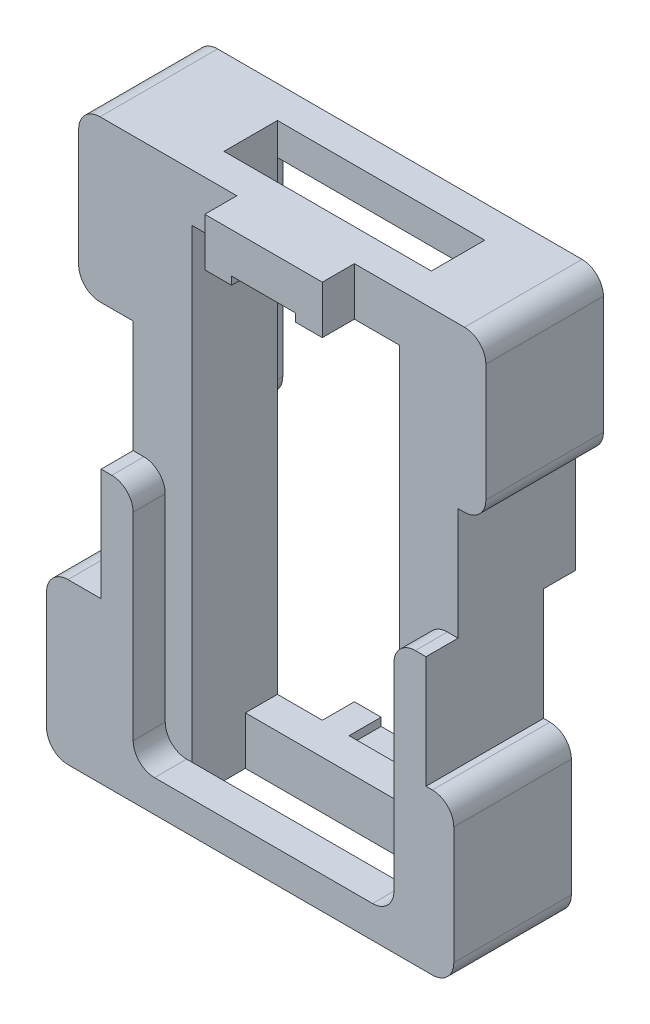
ISO-10303-21;
HEADER;
FILE_DESCRIPTION(('STEP AP214'),'2;1');
FILE_NAME('part.step','',(''),(''),'','','');
FILE_SCHEMA(('AUTOMOTIVE_DESIGN { 1 0 10303 214 1 1 1 1 }'));
ENDSEC;
DATA;
#1=APPLICATION_CONTEXT('core data for automotive mechanical design processes');
#2=APPLICATION_PROTOCOL_DEFINITION('international standard','automotive_design',2000,#1);
#3=PRODUCT_CONTEXT('',#1,'mechanical');
#4=PRODUCT('Part','Part','',(#3));
#5=PRODUCT_RELATED_PRODUCT_CATEGORY('part','',(#4));
#6=PRODUCT_DEFINITION_FORMATION('','',#4);
#7=PRODUCT_DEFINITION_CONTEXT('part definition',#1,'design');
#8=PRODUCT_DEFINITION('design','',#6,#7);
#9=PRODUCT_DEFINITION_SHAPE('','',#8);
#10=(LENGTH_UNIT() NAMED_UNIT(*) SI_UNIT(.MILLI.,.METRE.));
#11=(NAMED_UNIT(*) PLANE_ANGLE_UNIT() SI_UNIT($,.RADIAN.));
#12=(NAMED_UNIT(*) SI_UNIT($,.STERADIAN.) SOLID_ANGLE_UNIT());
#13=UNCERTAINTY_MEASURE_WITH_UNIT(LENGTH_MEASURE(1.E-05),#10,'distance_accuracy_value','');
#14=(GEOMETRIC_REPRESENTATION_CONTEXT(3) GLOBAL_UNCERTAINTY_ASSIGNED_CONTEXT((#13)) GLOBAL_UNIT_ASSIGNED_CONTEXT((#10,
#11,#12)) REPRESENTATION_CONTEXT('',''));
#15=CARTESIAN_POINT('',(0.,0.,0.));
#16=DIRECTION('',(0.,0.,1.));
#17=DIRECTION('',(1.,0.,0.));
#18=AXIS2_PLACEMENT_3D('',#15,#16,#17);
#19=CARTESIAN_POINT('',(0.,0.,4.));
#20=DIRECTION('',(0.,0.,1.));
#21=DIRECTION('',(1.,0.,0.));
#22=AXIS2_PLACEMENT_3D('',#19,#20,#21);
#23=PLANE('',#22);
#24=DIRECTION('',(0.,1.,0.));
#25=VECTOR('',#24,1.);
#26=CARTESIAN_POINT('',(9.7,21.,4.));
#27=LINE('',#26,#25);
#28=CARTESIAN_POINT('',(9.7,-22.5,4.));
#29=VERTEX_POINT('',#28);
#30=CARTESIAN_POINT('',(9.7,21.,4.));
#31=VERTEX_POINT('',#30);
#32=EDGE_CURVE('E862',#29,#31,#27,.T.);
#33=ORIENTED_EDGE('',*,*,#32,.F.);
#34=DIRECTION('',(-1.,0.,0.));
#35=VECTOR('',#34,1.);
#36=CARTESIAN_POINT('',(0.,-22.5,4.));
#37=LINE('',#36,#35);
#38=CARTESIAN_POINT('',(10.2,-22.5,4.));
#39=VERTEX_POINT('',#38);
#40=EDGE_CURVE('E851',#39,#29,#37,.T.);
#41=ORIENTED_EDGE('',*,*,#40,.F.);
#42=CARTESIAN_POINT('',(10.2,-20.5,4.));
#43=DIRECTION('',(0.,0.,1.));
#44=DIRECTION('',(1.,0.,0.));
#45=AXIS2_PLACEMENT_3D('',#42,#43,#44);
#46=CIRCLE('',#45,2.);
#47=CARTESIAN_POINT('',(12.2,-20.5,4.));
#48=VERTEX_POINT('',#47);
#49=EDGE_CURVE('E725',#39,#48,#46,.T.);
#50=ORIENTED_EDGE('',*,*,#49,.T.);
#51=DIRECTION('',(0.,-1.,0.));
#52=VECTOR('',#51,1.);
#53=CARTESIAN_POINT('',(12.2,0.,4.));
#54=LINE('',#53,#52);
#55=CARTESIAN_POINT('',(12.2,-2.,4.));
#56=VERTEX_POINT('',#55);
#57=EDGE_CURVE('E1201',#56,#48,#54,.T.);
#58=ORIENTED_EDGE('',*,*,#57,.F.);
#59=CARTESIAN_POINT('',(14.2,-2.,4.));
#60=DIRECTION('',(0.,0.,1.));
#61=DIRECTION('',(1.,0.,0.));
#62=AXIS2_PLACEMENT_3D('',#59,#60,#61);
#63=CIRCLE('',#62,2.);
#64=CARTESIAN_POINT('',(14.2,0.,4.));
#65=VERTEX_POINT('',#64);
#66=EDGE_CURVE('E812',#56,#65,#63,.F.);
#67=ORIENTED_EDGE('',*,*,#66,.T.);
#68=DIRECTION('',(-1.,0.,0.));
#69=VECTOR('',#68,1.);
#70=CARTESIAN_POINT('',(0.,0.,4.));
#71=LINE('',#70,#69);
#72=CARTESIAN_POINT('',(15.2,0.,4.));
#73=VERTEX_POINT('',#72);
#74=EDGE_CURVE('E1210',#73,#65,#71,.T.);
#75=ORIENTED_EDGE('',*,*,#74,.F.);
#76=DIRECTION('',(0.,1.,0.));
#77=VECTOR('',#76,1.);
#78=CARTESIAN_POINT('',(15.2,25.5,4.));
#79=LINE('',#78,#77);
#80=CARTESIAN_POINT('',(15.2,10.5,4.));
#81=VERTEX_POINT('',#80);
#82=EDGE_CURVE('E484',#73,#81,#79,.T.);
#83=ORIENTED_EDGE('',*,*,#82,.T.);
#84=DIRECTION('',(-1.,0.,0.));
#85=VECTOR('',#84,1.);
#86=CARTESIAN_POINT('',(17.8,10.5,4.));
#87=LINE('',#86,#85);
#88=CARTESIAN_POINT('',(15.8,10.5,4.));
#89=VERTEX_POINT('',#88);
#90=EDGE_CURVE('E550',#89,#81,#87,.T.);
#91=ORIENTED_EDGE('',*,*,#90,.F.);
#92=CARTESIAN_POINT('',(15.8,12.5,4.));
#93=DIRECTION('',(0.,0.,1.));
#94=DIRECTION('',(1.,0.,0.));
#95=AXIS2_PLACEMENT_3D('',#92,#93,#94);
#96=CIRCLE('',#95,2.);
#97=CARTESIAN_POINT('',(17.8,12.5,4.));
#98=VERTEX_POINT('',#97);
#99=EDGE_CURVE('E730',#89,#98,#96,.T.);
#100=ORIENTED_EDGE('',*,*,#99,.T.);
#101=DIRECTION('',(0.,-1.,0.));
#102=VECTOR('',#101,1.);
#103=CARTESIAN_POINT('',(17.8,25.5,4.));
#104=LINE('',#103,#102);
#105=CARTESIAN_POINT('',(17.8,23.5,4.));
#106=VERTEX_POINT('',#105);
#107=EDGE_CURVE('E1088',#106,#98,#104,.T.);
#108=ORIENTED_EDGE('',*,*,#107,.F.);
#109=CARTESIAN_POINT('',(15.8,23.5,4.));
#110=DIRECTION('',(0.,0.,1.));
#111=DIRECTION('',(1.,0.,0.));
#112=AXIS2_PLACEMENT_3D('',#109,#110,#111);
#113=CIRCLE('',#112,2.);
#114=CARTESIAN_POINT('',(15.8,25.5,4.));
#115=VERTEX_POINT('',#114);
#116=EDGE_CURVE('E723',#106,#115,#113,.T.);
#117=ORIENTED_EDGE('',*,*,#116,.T.);
#118=DIRECTION('',(-1.,0.,0.));
#119=VECTOR('',#118,1.);
#120=CARTESIAN_POINT('',(-15.2,25.5,4.));
#121=LINE('',#120,#119);
#122=CARTESIAN_POINT('',(5.5,25.5,4.));
#123=VERTEX_POINT('',#122);
#124=EDGE_CURVE('E489',#115,#123,#121,.T.);
#125=ORIENTED_EDGE('',*,*,#124,.T.);
#126=DIRECTION('',(0.,1.,0.));
#127=VECTOR('',#126,1.);
#128=CARTESIAN_POINT('',(5.5,0.,4.));
#129=LINE('',#128,#127);
#130=CARTESIAN_POINT('',(5.5,21.,4.));
#131=VERTEX_POINT('',#130);
#132=EDGE_CURVE('E907',#131,#123,#129,.T.);
#133=ORIENTED_EDGE('',*,*,#132,.F.);
#134=DIRECTION('',(-1.,0.,0.));
#135=VECTOR('',#134,1.);
#136=CARTESIAN_POINT('',(-9.7,21.,4.));
#137=LINE('',#136,#135);
#138=EDGE_CURVE('E866',#31,#131,#137,.T.);
#139=ORIENTED_EDGE('',*,*,#138,.F.);
#140=EDGE_LOOP('',(#33,#41,#50,#58,#67,#75,#83,#91,#100,#108,#117,#125,#133,#139));
#141=FACE_BOUND('',#140,.T.);
#142=ADVANCED_FACE('F34',(#141),#23,.T.);
#143=CARTESIAN_POINT('',(0.,0.,-4.));
#144=DIRECTION('',(0.,0.,1.));
#145=DIRECTION('',(1.,0.,0.));
#146=AXIS2_PLACEMENT_3D('',#143,#144,#145);
#147=PLANE('',#146);
#148=DIRECTION('',(-1.,0.,0.));
#149=VECTOR('',#148,1.);
#150=CARTESIAN_POINT('',(12.2,22.5,-4.));
#151=LINE('',#150,#149);
#152=CARTESIAN_POINT('',(-9.7,22.5,-4.));
#153=VERTEX_POINT('',#152);
#154=CARTESIAN_POINT('',(-10.2,22.5,-4.));
#155=VERTEX_POINT('',#154);
#156=EDGE_CURVE('E1146',#153,#155,#151,.T.);
#157=ORIENTED_EDGE('',*,*,#156,.F.);
#158=DIRECTION('',(0.,-1.,0.));
#159=VECTOR('',#158,1.);
#160=CARTESIAN_POINT('',(-9.7,21.,-4.));
#161=LINE('',#160,#159);
#162=CARTESIAN_POINT('',(-9.7,-21.,-4.));
#163=VERTEX_POINT('',#162);
#164=EDGE_CURVE('E850',#153,#163,#161,.T.);
#165=ORIENTED_EDGE('',*,*,#164,.T.);
#166=DIRECTION('',(1.,0.,0.));
#167=VECTOR('',#166,1.);
#168=CARTESIAN_POINT('',(-9.7,-21.,-4.));
#169=LINE('',#168,#167);
#170=CARTESIAN_POINT('',(-5.5,-21.,-4.));
#171=VERTEX_POINT('',#170);
#172=EDGE_CURVE('E870',#163,#171,#169,.T.);
#173=ORIENTED_EDGE('',*,*,#172,.T.);
#174=DIRECTION('',(0.,1.,0.));
#175=VECTOR('',#174,1.);
#176=CARTESIAN_POINT('',(-5.5,-25.5,-4.));
#177=LINE('',#176,#175);
#178=CARTESIAN_POINT('',(-5.5,-25.5,-4.));
#179=VERTEX_POINT('',#178);
#180=EDGE_CURVE('E599',#179,#171,#177,.T.);
#181=ORIENTED_EDGE('',*,*,#180,.F.);
#182=DIRECTION('',(1.,0.,0.));
#183=VECTOR('',#182,1.);
#184=CARTESIAN_POINT('',(-15.2,-25.5,-4.));
#185=LINE('',#184,#183);
#186=CARTESIAN_POINT('',(-18.3,-25.5,-4.));
#187=VERTEX_POINT('',#186);
#188=EDGE_CURVE('E494',#187,#179,#185,.T.);
#189=ORIENTED_EDGE('',*,*,#188,.F.);
#190=CARTESIAN_POINT('',(-18.3,-23.5,-4.));
#191=DIRECTION('',(0.,0.,1.));
#192=DIRECTION('',(1.,0.,0.));
#193=AXIS2_PLACEMENT_3D('',#190,#191,#192);
#194=CIRCLE('',#193,2.);
#195=CARTESIAN_POINT('',(-20.3,-23.5,-4.));
#196=VERTEX_POINT('',#195);
#197=EDGE_CURVE('E713',#187,#196,#194,.F.);
#198=ORIENTED_EDGE('',*,*,#197,.T.);
#199=DIRECTION('',(0.,-1.,0.));
#200=VECTOR('',#199,1.);
#201=CARTESIAN_POINT('',(-20.3,-25.5,-4.));
#202=LINE('',#201,#200);
#203=CARTESIAN_POINT('',(-20.3,-12.5,-4.));
#204=VERTEX_POINT('',#203);
#205=EDGE_CURVE('E575',#204,#196,#202,.T.);
#206=ORIENTED_EDGE('',*,*,#205,.F.);
#207=CARTESIAN_POINT('',(-18.3,-12.5,-4.));
#208=DIRECTION('',(0.,0.,1.));
#209=DIRECTION('',(1.,0.,0.));
#210=AXIS2_PLACEMENT_3D('',#207,#208,#209);
#211=CIRCLE('',#210,2.);
#212=CARTESIAN_POINT('',(-18.3,-10.5,-4.));
#213=VERTEX_POINT('',#212);
#214=EDGE_CURVE('E711',#204,#213,#211,.F.);
#215=ORIENTED_EDGE('',*,*,#214,.T.);
#216=DIRECTION('',(1.,0.,0.));
#217=VECTOR('',#216,1.);
#218=CARTESIAN_POINT('',(-20.3,-10.5,-4.));
#219=LINE('',#218,#217);
#220=CARTESIAN_POINT('',(-15.2,-10.5,-4.));
#221=VERTEX_POINT('',#220);
#222=EDGE_CURVE('E577',#213,#221,#219,.T.);
#223=ORIENTED_EDGE('',*,*,#222,.T.);
#224=DIRECTION('',(0.,-1.,0.));
#225=VECTOR('',#224,1.);
#226=CARTESIAN_POINT('',(-15.2,25.5,-4.));
#227=LINE('',#226,#225);
#228=CARTESIAN_POINT('',(-15.2,0.,-4.));
#229=VERTEX_POINT('',#228);
#230=EDGE_CURVE('E474',#229,#221,#227,.T.);
#231=ORIENTED_EDGE('',*,*,#230,.F.);
#232=DIRECTION('',(-1.,0.,0.));
#233=VECTOR('',#232,1.);
#234=CARTESIAN_POINT('',(-12.2,0.,-4.));
#235=LINE('',#234,#233);
#236=CARTESIAN_POINT('',(-14.2,0.,-4.));
#237=VERTEX_POINT('',#236);
#238=EDGE_CURVE('E505',#237,#229,#235,.T.);
#239=ORIENTED_EDGE('',*,*,#238,.F.);
#240=CARTESIAN_POINT('',(-14.2,2.,-4.));
#241=DIRECTION('',(0.,0.,1.));
#242=DIRECTION('',(1.,0.,0.));
#243=AXIS2_PLACEMENT_3D('',#240,#241,#242);
#244=CIRCLE('',#243,2.);
#245=CARTESIAN_POINT('',(-12.2,2.00000000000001,-4.));
#246=VERTEX_POINT('',#245);
#247=EDGE_CURVE('E816',#237,#246,#244,.T.);
#248=ORIENTED_EDGE('',*,*,#247,.T.);
#249=DIRECTION('',(0.,-1.,0.));
#250=VECTOR('',#249,1.);
#251=CARTESIAN_POINT('',(-12.2,22.5,-4.));
#252=LINE('',#251,#250);
#253=CARTESIAN_POINT('',(-12.2,20.5,-4.));
#254=VERTEX_POINT('',#253);
#255=EDGE_CURVE('E640',#254,#246,#252,.T.);
#256=ORIENTED_EDGE('',*,*,#255,.F.);
#257=CARTESIAN_POINT('',(-10.2,20.5,-4.));
#258=DIRECTION('',(0.,0.,1.));
#259=DIRECTION('',(1.,0.,0.));
#260=AXIS2_PLACEMENT_3D('',#257,#258,#259);
#261=CIRCLE('',#260,2.);
#262=EDGE_CURVE('E697',#254,#155,#261,.F.);
#263=ORIENTED_EDGE('',*,*,#262,.T.);
#264=EDGE_LOOP('',(#157,#165,#173,#181,#189,#198,#206,#215,#223,#231,#239,#248,#256,#263));
#265=FACE_BOUND('',#264,.T.);
#266=ADVANCED_FACE('F984',(#265),#147,.F.);
#267=CARTESIAN_POINT('',(15.2,25.5,4.));
#268=DIRECTION('',(-1.,0.,0.));
#269=DIRECTION('',(0.,-1.,0.));
#270=AXIS2_PLACEMENT_3D('',#267,#268,#269);
#271=PLANE('',#270);
#272=DIRECTION('',(0.,0.,-1.));
#273=VECTOR('',#272,1.);
#274=CARTESIAN_POINT('',(15.2,10.5,-7.));
#275=LINE('',#274,#273);
#276=CARTESIAN_POINT('',(15.2,10.5,-7.));
#277=VERTEX_POINT('',#276);
#278=EDGE_CURVE('E1089',#81,#277,#275,.T.);
#279=ORIENTED_EDGE('',*,*,#278,.F.);
#280=ORIENTED_EDGE('',*,*,#82,.F.);
#281=DIRECTION('',(0.,0.,1.));
#282=VECTOR('',#281,1.);
#283=CARTESIAN_POINT('',(15.2,0.,-43.6788356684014));
#284=LINE('',#283,#282);
#285=CARTESIAN_POINT('',(15.2,0.,7.));
#286=VERTEX_POINT('',#285);
#287=EDGE_CURVE('E1206',#73,#286,#284,.T.);
#288=ORIENTED_EDGE('',*,*,#287,.T.);
#289=DIRECTION('',(0.,1.,0.));
#290=VECTOR('',#289,1.);
#291=CARTESIAN_POINT('',(15.2,-25.5,7.));
#292=LINE('',#291,#290);
#293=CARTESIAN_POINT('',(15.2,-10.5,7.));
#294=VERTEX_POINT('',#293);
#295=EDGE_CURVE('E535',#294,#286,#292,.T.);
#296=ORIENTED_EDGE('',*,*,#295,.F.);
#297=DIRECTION('',(0.,0.,1.));
#298=VECTOR('',#297,1.);
#299=CARTESIAN_POINT('',(15.2,-10.5,-4.));
#300=LINE('',#299,#298);
#301=CARTESIAN_POINT('',(15.2,-10.5,-4.));
#302=VERTEX_POINT('',#301);
#303=EDGE_CURVE('E545',#302,#294,#300,.T.);
#304=ORIENTED_EDGE('',*,*,#303,.F.);
#305=DIRECTION('',(0.,1.,0.));
#306=VECTOR('',#305,1.);
#307=CARTESIAN_POINT('',(15.2,25.5,-4.));
#308=LINE('',#307,#306);
#309=CARTESIAN_POINT('',(15.2,0.,-4.));
#310=VERTEX_POINT('',#309);
#311=EDGE_CURVE('E485',#302,#310,#308,.T.);
#312=ORIENTED_EDGE('',*,*,#311,.T.);
#313=DIRECTION('',(0.,0.,1.));
#314=VECTOR('',#313,1.);
#315=CARTESIAN_POINT('',(15.2,0.,-7.));
#316=LINE('',#315,#314);
#317=CARTESIAN_POINT('',(15.2,0.,-7.));
#318=VERTEX_POINT('',#317);
#319=EDGE_CURVE('E508',#318,#310,#316,.T.);
#320=ORIENTED_EDGE('',*,*,#319,.F.);
#321=DIRECTION('',(0.,-1.,0.));
#322=VECTOR('',#321,1.);
#323=CARTESIAN_POINT('',(15.2,25.5,-7.));
#324=LINE('',#323,#322);
#325=EDGE_CURVE('E646',#277,#318,#324,.T.);
#326=ORIENTED_EDGE('',*,*,#325,.F.);
#327=EDGE_LOOP('',(#279,#280,#288,#296,#304,#312,#320,#326));
#328=FACE_BOUND('',#327,.T.);
#329=ADVANCED_FACE('F990',(#328),#271,.F.);
#330=CARTESIAN_POINT('',(-15.2,25.5,4.));
#331=DIRECTION('',(1.,0.,0.));
#332=DIRECTION('',(0.,0.,-1.));
#333=AXIS2_PLACEMENT_3D('',#330,#331,#332);
#334=PLANE('',#333);
#335=DIRECTION('',(0.,0.,1.));
#336=VECTOR('',#335,1.);
#337=CARTESIAN_POINT('',(-15.2,10.5,-7.));
#338=LINE('',#337,#336);
#339=CARTESIAN_POINT('',(-15.2,10.5,-7.));
#340=VERTEX_POINT('',#339);
#341=CARTESIAN_POINT('',(-15.2,10.5,4.));
#342=VERTEX_POINT('',#341);
#343=EDGE_CURVE('E562',#340,#342,#338,.T.);
#344=ORIENTED_EDGE('',*,*,#343,.F.);
#345=DIRECTION('',(0.,1.,0.));
#346=VECTOR('',#345,1.);
#347=CARTESIAN_POINT('',(-15.2,0.,-7.));
#348=LINE('',#347,#346);
#349=CARTESIAN_POINT('',(-15.2,0.,-7.));
#350=VERTEX_POINT('',#349);
#351=EDGE_CURVE('E639',#350,#340,#348,.T.);
#352=ORIENTED_EDGE('',*,*,#351,.F.);
#353=DIRECTION('',(0.,0.,1.));
#354=VECTOR('',#353,1.);
#355=CARTESIAN_POINT('',(-15.2,0.,-7.));
#356=LINE('',#355,#354);
#357=EDGE_CURVE('E511',#350,#229,#356,.T.);
#358=ORIENTED_EDGE('',*,*,#357,.T.);
#359=ORIENTED_EDGE('',*,*,#230,.T.);
#360=DIRECTION('',(0.,0.,-1.));
#361=VECTOR('',#360,1.);
#362=CARTESIAN_POINT('',(-15.2,-10.5,7.));
#363=LINE('',#362,#361);
#364=CARTESIAN_POINT('',(-15.2,-10.5,7.));
#365=VERTEX_POINT('',#364);
#366=EDGE_CURVE('E526',#365,#221,#363,.T.);
#367=ORIENTED_EDGE('',*,*,#366,.F.);
#368=DIRECTION('',(0.,-1.,0.));
#369=VECTOR('',#368,1.);
#370=CARTESIAN_POINT('',(-15.2,0.,7.));
#371=LINE('',#370,#369);
#372=CARTESIAN_POINT('',(-15.2,0.,7.));
#373=VERTEX_POINT('',#372);
#374=EDGE_CURVE('E520',#373,#365,#371,.T.);
#375=ORIENTED_EDGE('',*,*,#374,.F.);
#376=DIRECTION('',(0.,0.,1.));
#377=VECTOR('',#376,1.);
#378=CARTESIAN_POINT('',(-15.2,0.,-43.6788356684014));
#379=LINE('',#378,#377);
#380=CARTESIAN_POINT('',(-15.2,0.,4.));
#381=VERTEX_POINT('',#380);
#382=EDGE_CURVE('E1207',#381,#373,#379,.T.);
#383=ORIENTED_EDGE('',*,*,#382,.F.);
#384=DIRECTION('',(0.,-1.,0.));
#385=VECTOR('',#384,1.);
#386=CARTESIAN_POINT('',(-15.2,25.5,4.));
#387=LINE('',#386,#385);
#388=EDGE_CURVE('E481',#342,#381,#387,.T.);
#389=ORIENTED_EDGE('',*,*,#388,.F.);
#390=EDGE_LOOP('',(#344,#352,#358,#359,#367,#375,#383,#389));
#391=FACE_BOUND('',#390,.T.);
#392=ADVANCED_FACE('F1010',(#391),#334,.F.);
#393=DIRECTION('',(0.,1.,0.));
#394=VECTOR('',#393,1.);
#395=CARTESIAN_POINT('',(9.7,21.,-4.));
#396=LINE('',#395,#394);
#397=CARTESIAN_POINT('',(9.70000000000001,-21.,-4.));
#398=VERTEX_POINT('',#397);
#399=CARTESIAN_POINT('',(9.7,22.5,-4.));
#400=VERTEX_POINT('',#399);
#401=EDGE_CURVE('E471',#398,#400,#396,.T.);
#402=ORIENTED_EDGE('',*,*,#401,.T.);
#403=CARTESIAN_POINT('',(10.2,22.5,-4.));
#404=VERTEX_POINT('',#403);
#405=EDGE_CURVE('E1245',#404,#400,#151,.T.);
#406=ORIENTED_EDGE('',*,*,#405,.F.);
#407=CARTESIAN_POINT('',(10.2,20.5,-4.));
#408=DIRECTION('',(0.,0.,1.));
#409=DIRECTION('',(1.,0.,0.));
#410=AXIS2_PLACEMENT_3D('',#407,#408,#409);
#411=CIRCLE('',#410,2.);
#412=CARTESIAN_POINT('',(12.2,20.5,-4.));
#413=VERTEX_POINT('',#412);
#414=EDGE_CURVE('E702',#404,#413,#411,.F.);
#415=ORIENTED_EDGE('',*,*,#414,.T.);
#416=DIRECTION('',(0.,1.,0.));
#417=VECTOR('',#416,1.);
#418=CARTESIAN_POINT('',(12.2,0.,-4.));
#419=LINE('',#418,#417);
#420=CARTESIAN_POINT('',(12.2,2.,-4.));
#421=VERTEX_POINT('',#420);
#422=EDGE_CURVE('E504',#421,#413,#419,.T.);
#423=ORIENTED_EDGE('',*,*,#422,.F.);
#424=CARTESIAN_POINT('',(14.2,2.,-4.));
#425=DIRECTION('',(0.,0.,1.));
#426=DIRECTION('',(1.,0.,0.));
#427=AXIS2_PLACEMENT_3D('',#424,#425,#426);
#428=CIRCLE('',#427,2.);
#429=CARTESIAN_POINT('',(14.2,0.,-4.));
#430=VERTEX_POINT('',#429);
#431=EDGE_CURVE('E814',#421,#430,#428,.T.);
#432=ORIENTED_EDGE('',*,*,#431,.T.);
#433=DIRECTION('',(-1.,0.,0.));
#434=VECTOR('',#433,1.);
#435=CARTESIAN_POINT('',(15.2,0.,-4.));
#436=LINE('',#435,#434);
#437=EDGE_CURVE('E501',#310,#430,#436,.T.);
#438=ORIENTED_EDGE('',*,*,#437,.F.);
#439=ORIENTED_EDGE('',*,*,#311,.F.);
#440=DIRECTION('',(-1.,0.,0.));
#441=VECTOR('',#440,1.);
#442=CARTESIAN_POINT('',(17.8,-10.5,-4.));
#443=LINE('',#442,#441);
#444=CARTESIAN_POINT('',(15.8,-10.5,-4.));
#445=VERTEX_POINT('',#444);
#446=EDGE_CURVE('E568',#445,#302,#443,.T.);
#447=ORIENTED_EDGE('',*,*,#446,.F.);
#448=CARTESIAN_POINT('',(15.8,-12.5,-4.));
#449=DIRECTION('',(0.,0.,1.));
#450=DIRECTION('',(1.,0.,0.));
#451=AXIS2_PLACEMENT_3D('',#448,#449,#450);
#452=CIRCLE('',#451,2.);
#453=CARTESIAN_POINT('',(17.8,-12.5,-4.));
#454=VERTEX_POINT('',#453);
#455=EDGE_CURVE('E707',#445,#454,#452,.F.);
#456=ORIENTED_EDGE('',*,*,#455,.T.);
#457=DIRECTION('',(0.,1.,0.));
#458=VECTOR('',#457,1.);
#459=CARTESIAN_POINT('',(17.8,-25.5,-4.));
#460=LINE('',#459,#458);
#461=CARTESIAN_POINT('',(17.8,-23.5,-4.));
#462=VERTEX_POINT('',#461);
#463=EDGE_CURVE('E549',#462,#454,#460,.T.);
#464=ORIENTED_EDGE('',*,*,#463,.F.);
#465=CARTESIAN_POINT('',(15.8,-23.5,-4.));
#466=DIRECTION('',(0.,0.,1.));
#467=DIRECTION('',(1.,0.,0.));
#468=AXIS2_PLACEMENT_3D('',#465,#466,#467);
#469=CIRCLE('',#468,2.);
#470=CARTESIAN_POINT('',(15.8,-25.5,-4.));
#471=VERTEX_POINT('',#470);
#472=EDGE_CURVE('E668',#462,#471,#469,.F.);
#473=ORIENTED_EDGE('',*,*,#472,.T.);
#474=CARTESIAN_POINT('',(5.49999999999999,-25.5,-4.));
#475=VERTEX_POINT('',#474);
#476=EDGE_CURVE('E499',#475,#471,#185,.T.);
#477=ORIENTED_EDGE('',*,*,#476,.F.);
#478=DIRECTION('',(0.,-1.,0.));
#479=VECTOR('',#478,1.);
#480=CARTESIAN_POINT('',(5.5,-21.,-4.));
#481=LINE('',#480,#479);
#482=CARTESIAN_POINT('',(5.5,-21.,-4.));
#483=VERTEX_POINT('',#482);
#484=EDGE_CURVE('E584',#483,#475,#481,.T.);
#485=ORIENTED_EDGE('',*,*,#484,.F.);
#486=EDGE_CURVE('E854',#483,#398,#169,.T.);
#487=ORIENTED_EDGE('',*,*,#486,.T.);
#488=EDGE_LOOP('',(#402,#406,#415,#423,#432,#438,#439,#447,#456,#464,#473,#477,#485,#487));
#489=FACE_BOUND('',#488,.T.);
#490=ADVANCED_FACE('F993',(#489),#147,.F.);
#491=DIRECTION('',(0.,-1.,0.));
#492=VECTOR('',#491,1.);
#493=CARTESIAN_POINT('',(-3.,-21.,-4.));
#494=LINE('',#493,#492);
#495=CARTESIAN_POINT('',(-3.,-21.,-4.));
#496=VERTEX_POINT('',#495);
#497=CARTESIAN_POINT('',(-3.,-21.75,-4.));
#498=VERTEX_POINT('',#497);
#499=EDGE_CURVE('E602',#496,#498,#494,.T.);
#500=ORIENTED_EDGE('',*,*,#499,.F.);
#501=CARTESIAN_POINT('',(3.,-21.,-4.));
#502=VERTEX_POINT('',#501);
#503=EDGE_CURVE('E872',#496,#502,#169,.T.);
#504=ORIENTED_EDGE('',*,*,#503,.T.);
#505=DIRECTION('',(0.,1.,0.));
#506=VECTOR('',#505,1.);
#507=CARTESIAN_POINT('',(3.,-21.75,-4.));
#508=LINE('',#507,#506);
#509=CARTESIAN_POINT('',(3.,-21.75,-4.));
#510=VERTEX_POINT('',#509);
#511=EDGE_CURVE('E609',#510,#502,#508,.T.);
#512=ORIENTED_EDGE('',*,*,#511,.F.);
#513=DIRECTION('',(1.,0.,0.));
#514=VECTOR('',#513,1.);
#515=CARTESIAN_POINT('',(-3.,-21.75,-4.));
#516=LINE('',#515,#514);
#517=EDGE_CURVE('E606',#498,#510,#516,.T.);
#518=ORIENTED_EDGE('',*,*,#517,.F.);
#519=EDGE_LOOP('',(#500,#504,#512,#518));
#520=FACE_BOUND('',#519,.T.);
#521=ADVANCED_FACE('F992',(#520),#147,.F.);
#522=CARTESIAN_POINT('',(-9.7,-22.5,4.));
#523=VERTEX_POINT('',#522);
#524=CARTESIAN_POINT('',(-10.2,-22.5,4.));
#525=VERTEX_POINT('',#524);
#526=EDGE_CURVE('E845',#523,#525,#37,.T.);
#527=ORIENTED_EDGE('',*,*,#526,.F.);
#528=DIRECTION('',(0.,-1.,0.));
#529=VECTOR('',#528,1.);
#530=CARTESIAN_POINT('',(-9.7,21.,4.));
#531=LINE('',#530,#529);
#532=CARTESIAN_POINT('',(-9.7,21.,4.));
#533=VERTEX_POINT('',#532);
#534=EDGE_CURVE('E56',#533,#523,#531,.T.);
#535=ORIENTED_EDGE('',*,*,#534,.F.);
#536=CARTESIAN_POINT('',(-5.5,21.,4.));
#537=VERTEX_POINT('',#536);
#538=EDGE_CURVE('E865',#537,#533,#137,.T.);
#539=ORIENTED_EDGE('',*,*,#538,.F.);
#540=DIRECTION('',(0.,-1.,0.));
#541=VECTOR('',#540,1.);
#542=CARTESIAN_POINT('',(-5.49999999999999,0.,4.));
#543=LINE('',#542,#541);
#544=CARTESIAN_POINT('',(-5.5,25.5,4.));
#545=VERTEX_POINT('',#544);
#546=EDGE_CURVE('E886',#545,#537,#543,.T.);
#547=ORIENTED_EDGE('',*,*,#546,.F.);
#548=CARTESIAN_POINT('',(-18.3,25.5,4.));
#549=VERTEX_POINT('',#548);
#550=EDGE_CURVE('E488',#545,#549,#121,.T.);
#551=ORIENTED_EDGE('',*,*,#550,.T.);
#552=CARTESIAN_POINT('',(-18.3,23.5,4.));
#553=DIRECTION('',(0.,0.,1.));
#554=DIRECTION('',(1.,0.,0.));
#555=AXIS2_PLACEMENT_3D('',#552,#553,#554);
#556=CIRCLE('',#555,2.);
#557=CARTESIAN_POINT('',(-20.3,23.5,4.));
#558=VERTEX_POINT('',#557);
#559=EDGE_CURVE('E732',#549,#558,#556,.T.);
#560=ORIENTED_EDGE('',*,*,#559,.T.);
#561=DIRECTION('',(0.,1.,0.));
#562=VECTOR('',#561,1.);
#563=CARTESIAN_POINT('',(-20.3,25.5,4.));
#564=LINE('',#563,#562);
#565=CARTESIAN_POINT('',(-20.3,12.5,4.));
#566=VERTEX_POINT('',#565);
#567=EDGE_CURVE('E561',#566,#558,#564,.T.);
#568=ORIENTED_EDGE('',*,*,#567,.F.);
#569=CARTESIAN_POINT('',(-18.3,12.5,4.));
#570=DIRECTION('',(0.,0.,1.));
#571=DIRECTION('',(1.,0.,0.));
#572=AXIS2_PLACEMENT_3D('',#569,#570,#571);
#573=CIRCLE('',#572,2.);
#574=CARTESIAN_POINT('',(-18.3,10.5,4.));
#575=VERTEX_POINT('',#574);
#576=EDGE_CURVE('E734',#566,#575,#573,.T.);
#577=ORIENTED_EDGE('',*,*,#576,.T.);
#578=DIRECTION('',(1.,0.,0.));
#579=VECTOR('',#578,1.);
#580=CARTESIAN_POINT('',(-20.3,10.5,4.));
#581=LINE('',#580,#579);
#582=EDGE_CURVE('E565',#575,#342,#581,.T.);
#583=ORIENTED_EDGE('',*,*,#582,.T.);
#584=ORIENTED_EDGE('',*,*,#388,.T.);
#585=DIRECTION('',(-1.,0.,0.));
#586=VECTOR('',#585,1.);
#587=CARTESIAN_POINT('',(0.,0.,4.));
#588=LINE('',#587,#586);
#589=CARTESIAN_POINT('',(-14.2,0.,4.));
#590=VERTEX_POINT('',#589);
#591=EDGE_CURVE('E1215',#590,#381,#588,.T.);
#592=ORIENTED_EDGE('',*,*,#591,.F.);
#593=CARTESIAN_POINT('',(-14.2,-2.00000000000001,4.));
#594=DIRECTION('',(0.,0.,1.));
#595=DIRECTION('',(1.,0.,0.));
#596=AXIS2_PLACEMENT_3D('',#593,#594,#595);
#597=CIRCLE('',#596,2.);
#598=CARTESIAN_POINT('',(-12.2,-2.00000000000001,4.));
#599=VERTEX_POINT('',#598);
#600=EDGE_CURVE('E810',#590,#599,#597,.F.);
#601=ORIENTED_EDGE('',*,*,#600,.T.);
#602=DIRECTION('',(0.,1.,0.));
#603=VECTOR('',#602,1.);
#604=CARTESIAN_POINT('',(-12.2,0.,4.));
#605=LINE('',#604,#603);
#606=CARTESIAN_POINT('',(-12.2,-20.5,4.));
#607=VERTEX_POINT('',#606);
#608=EDGE_CURVE('E847',#607,#599,#605,.T.);
#609=ORIENTED_EDGE('',*,*,#608,.F.);
#610=CARTESIAN_POINT('',(-10.2,-20.5,4.));
#611=DIRECTION('',(0.,0.,1.));
#612=DIRECTION('',(1.,0.,0.));
#613=AXIS2_PLACEMENT_3D('',#610,#611,#612);
#614=CIRCLE('',#613,2.);
#615=EDGE_CURVE('E727',#607,#525,#614,.T.);
#616=ORIENTED_EDGE('',*,*,#615,.T.);
#617=EDGE_LOOP('',(#527,#535,#539,#547,#551,#560,#568,#577,#583,#584,#592,#601,#609,#616));
#618=FACE_BOUND('',#617,.T.);
#619=ADVANCED_FACE('F844',(#618),#23,.T.);
#620=DIRECTION('',(0.,-1.,0.));
#621=VECTOR('',#620,1.);
#622=CARTESIAN_POINT('',(3.00000000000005,0.,4.));
#623=LINE('',#622,#621);
#624=CARTESIAN_POINT('',(3.,21.75,4.));
#625=VERTEX_POINT('',#624);
#626=CARTESIAN_POINT('',(3.00000000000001,21.,4.));
#627=VERTEX_POINT('',#626);
#628=EDGE_CURVE('E901',#625,#627,#623,.T.);
#629=ORIENTED_EDGE('',*,*,#628,.F.);
#630=DIRECTION('',(1.,0.,0.));
#631=VECTOR('',#630,1.);
#632=CARTESIAN_POINT('',(0.,21.75,4.));
#633=LINE('',#632,#631);
#634=CARTESIAN_POINT('',(-3.,21.75,4.));
#635=VERTEX_POINT('',#634);
#636=EDGE_CURVE('E525',#635,#625,#633,.T.);
#637=ORIENTED_EDGE('',*,*,#636,.F.);
#638=DIRECTION('',(0.,1.,0.));
#639=VECTOR('',#638,1.);
#640=CARTESIAN_POINT('',(-3.,0.,4.));
#641=LINE('',#640,#639);
#642=CARTESIAN_POINT('',(-3.,21.,4.));
#643=VERTEX_POINT('',#642);
#644=EDGE_CURVE('E902',#643,#635,#641,.T.);
#645=ORIENTED_EDGE('',*,*,#644,.F.);
#646=EDGE_CURVE('E868',#627,#643,#137,.T.);
#647=ORIENTED_EDGE('',*,*,#646,.F.);
#648=EDGE_LOOP('',(#629,#637,#645,#647));
#649=FACE_BOUND('',#648,.T.);
#650=ADVANCED_FACE('F899',(#649),#23,.T.);
#651=CARTESIAN_POINT('',(-15.2,-25.5,4.));
#652=DIRECTION('',(0.,1.,0.));
#653=DIRECTION('',(-1.,0.,0.));
#654=AXIS2_PLACEMENT_3D('',#651,#652,#653);
#655=PLANE('',#654);
#656=DIRECTION('',(0.,0.,1.));
#657=VECTOR('',#656,1.);
#658=CARTESIAN_POINT('',(9.7,-25.5,4.));
#659=LINE('',#658,#657);
#660=CARTESIAN_POINT('',(9.7,-25.5,-1.));
#661=VERTEX_POINT('',#660);
#662=CARTESIAN_POINT('',(9.7,-25.5,4.));
#663=VERTEX_POINT('',#662);
#664=EDGE_CURVE('E1183',#661,#663,#659,.T.);
#665=ORIENTED_EDGE('',*,*,#664,.F.);
#666=DIRECTION('',(1.,0.,0.));
#667=VECTOR('',#666,1.);
#668=CARTESIAN_POINT('',(-9.7,-25.5,-1.));
#669=LINE('',#668,#667);
#670=CARTESIAN_POINT('',(-9.7,-25.5,-1.));
#671=VERTEX_POINT('',#670);
#672=EDGE_CURVE('E452',#671,#661,#669,.T.);
#673=ORIENTED_EDGE('',*,*,#672,.F.);
#674=DIRECTION('',(0.,0.,-1.));
#675=VECTOR('',#674,1.);
#676=CARTESIAN_POINT('',(-9.7,-25.5,4.));
#677=LINE('',#676,#675);
#678=CARTESIAN_POINT('',(-9.7,-25.5,4.));
#679=VERTEX_POINT('',#678);
#680=EDGE_CURVE('E1180',#679,#671,#677,.T.);
#681=ORIENTED_EDGE('',*,*,#680,.F.);
#682=DIRECTION('',(-1.,0.,0.));
#683=VECTOR('',#682,1.);
#684=CARTESIAN_POINT('',(-9.7,-25.5,4.));
#685=LINE('',#684,#683);
#686=EDGE_CURVE('E49',#663,#679,#685,.T.);
#687=ORIENTED_EDGE('',*,*,#686,.F.);
#688=EDGE_LOOP('',(#665,#673,#681,#687));
#689=FACE_BOUND('',#688,.T.);
#690=DIRECTION('',(1.,0.,0.));
#691=VECTOR('',#690,1.);
#692=CARTESIAN_POINT('',(-15.2,-25.5,7.));
#693=LINE('',#692,#691);
#694=CARTESIAN_POINT('',(-18.3,-25.5,7.));
#695=VERTEX_POINT('',#694);
#696=CARTESIAN_POINT('',(15.8,-25.5,7.));
#697=VERTEX_POINT('',#696);
#698=EDGE_CURVE('E524',#695,#697,#693,.T.);
#699=ORIENTED_EDGE('',*,*,#698,.F.);
#700=DIRECTION('',(0.,0.,1.));
#701=VECTOR('',#700,1.);
#702=CARTESIAN_POINT('',(-18.3,-25.5,-4.));
#703=LINE('',#702,#701);
#704=EDGE_CURVE('E692',#695,#187,#703,.F.);
#705=ORIENTED_EDGE('',*,*,#704,.T.);
#706=ORIENTED_EDGE('',*,*,#188,.T.);
#707=DIRECTION('',(0.,0.,1.));
#708=VECTOR('',#707,1.);
#709=CARTESIAN_POINT('',(-5.5,-25.5,-7.));
#710=LINE('',#709,#708);
#711=CARTESIAN_POINT('',(-5.5,-25.5,-7.));
#712=VERTEX_POINT('',#711);
#713=EDGE_CURVE('E634',#712,#179,#710,.T.);
#714=ORIENTED_EDGE('',*,*,#713,.F.);
#715=DIRECTION('',(-1.,0.,0.));
#716=VECTOR('',#715,1.);
#717=CARTESIAN_POINT('',(5.5,-25.5,-7.));
#718=LINE('',#717,#716);
#719=CARTESIAN_POINT('',(5.5,-25.5,-7.));
#720=VERTEX_POINT('',#719);
#721=EDGE_CURVE('E580',#720,#712,#718,.T.);
#722=ORIENTED_EDGE('',*,*,#721,.F.);
#723=DIRECTION('',(0.,0.,1.));
#724=VECTOR('',#723,1.);
#725=CARTESIAN_POINT('',(5.5,-25.5,-7.));
#726=LINE('',#725,#724);
#727=EDGE_CURVE('E598',#720,#475,#726,.T.);
#728=ORIENTED_EDGE('',*,*,#727,.T.);
#729=ORIENTED_EDGE('',*,*,#476,.T.);
#730=DIRECTION('',(0.,0.,-1.));
#731=VECTOR('',#730,1.);
#732=CARTESIAN_POINT('',(15.8,-25.5,7.));
#733=LINE('',#732,#731);
#734=EDGE_CURVE('E691',#471,#697,#733,.F.);
#735=ORIENTED_EDGE('',*,*,#734,.T.);
#736=EDGE_LOOP('',(#699,#705,#706,#714,#722,#728,#729,#735));
#737=FACE_BOUND('',#736,.T.);
#738=ADVANCED_FACE('F997',(#689,#737),#655,.F.);
#739=CARTESIAN_POINT('',(-15.2,25.5,4.));
#740=DIRECTION('',(0.,-1.,0.));
#741=DIRECTION('',(1.,0.,0.));
#742=AXIS2_PLACEMENT_3D('',#739,#740,#741);
#743=PLANE('',#742);
#744=DIRECTION('',(1.,0.,0.));
#745=VECTOR('',#744,1.);
#746=CARTESIAN_POINT('',(9.7,25.5,1.));
#747=LINE('',#746,#745);
#748=CARTESIAN_POINT('',(-9.7,25.5,1.));
#749=VERTEX_POINT('',#748);
#750=CARTESIAN_POINT('',(9.7,25.5,1.));
#751=VERTEX_POINT('',#750);
#752=EDGE_CURVE('E1166',#749,#751,#747,.T.);
#753=ORIENTED_EDGE('',*,*,#752,.F.);
#754=DIRECTION('',(0.,0.,1.));
#755=VECTOR('',#754,1.);
#756=CARTESIAN_POINT('',(-9.7,25.5,1.));
#757=LINE('',#756,#755);
#758=CARTESIAN_POINT('',(-9.7,25.5,-4.));
#759=VERTEX_POINT('',#758);
#760=EDGE_CURVE('E1169',#759,#749,#757,.T.);
#761=ORIENTED_EDGE('',*,*,#760,.F.);
#762=DIRECTION('',(-1.,0.,0.));
#763=VECTOR('',#762,1.);
#764=CARTESIAN_POINT('',(9.7,25.5,-4.));
#765=LINE('',#764,#763);
#766=CARTESIAN_POINT('',(9.7,25.5,-4.));
#767=VERTEX_POINT('',#766);
#768=EDGE_CURVE('E1155',#767,#759,#765,.T.);
#769=ORIENTED_EDGE('',*,*,#768,.F.);
#770=DIRECTION('',(0.,0.,-1.));
#771=VECTOR('',#770,1.);
#772=CARTESIAN_POINT('',(9.7,25.5,1.));
#773=LINE('',#772,#771);
#774=EDGE_CURVE('E1163',#751,#767,#773,.T.);
#775=ORIENTED_EDGE('',*,*,#774,.F.);
#776=EDGE_LOOP('',(#753,#761,#769,#775));
#777=FACE_BOUND('',#776,.T.);
#778=DIRECTION('',(1.,0.,0.));
#779=VECTOR('',#778,1.);
#780=CARTESIAN_POINT('',(-15.2,25.5,-7.));
#781=LINE('',#780,#779);
#782=CARTESIAN_POINT('',(-18.3,25.5,-7.));
#783=VERTEX_POINT('',#782);
#784=CARTESIAN_POINT('',(15.8,25.5,-7.));
#785=VERTEX_POINT('',#784);
#786=EDGE_CURVE('E643',#783,#785,#781,.T.);
#787=ORIENTED_EDGE('',*,*,#786,.F.);
#788=DIRECTION('',(0.,0.,-1.));
#789=VECTOR('',#788,1.);
#790=CARTESIAN_POINT('',(-18.3,25.5,4.));
#791=LINE('',#790,#789);
#792=EDGE_CURVE('E752',#783,#549,#791,.F.);
#793=ORIENTED_EDGE('',*,*,#792,.T.);
#794=ORIENTED_EDGE('',*,*,#550,.F.);
#795=DIRECTION('',(0.,0.,1.));
#796=VECTOR('',#795,1.);
#797=CARTESIAN_POINT('',(-5.5,25.5,-43.6788356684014));
#798=LINE('',#797,#796);
#799=CARTESIAN_POINT('',(-5.5,25.5,7.));
#800=VERTEX_POINT('',#799);
#801=EDGE_CURVE('E905',#545,#800,#798,.T.);
#802=ORIENTED_EDGE('',*,*,#801,.T.);
#803=DIRECTION('',(-1.,0.,0.));
#804=VECTOR('',#803,1.);
#805=CARTESIAN_POINT('',(-5.5,25.5,7.));
#806=LINE('',#805,#804);
#807=CARTESIAN_POINT('',(5.5,25.5,7.));
#808=VERTEX_POINT('',#807);
#809=EDGE_CURVE('E934',#808,#800,#806,.T.);
#810=ORIENTED_EDGE('',*,*,#809,.F.);
#811=DIRECTION('',(0.,0.,1.));
#812=VECTOR('',#811,1.);
#813=CARTESIAN_POINT('',(5.5,25.5,-43.6788356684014));
#814=LINE('',#813,#812);
#815=EDGE_CURVE('E909',#123,#808,#814,.T.);
#816=ORIENTED_EDGE('',*,*,#815,.F.);
#817=ORIENTED_EDGE('',*,*,#124,.F.);
#818=DIRECTION('',(0.,0.,1.));
#819=VECTOR('',#818,1.);
#820=CARTESIAN_POINT('',(15.8,25.5,4.));
#821=LINE('',#820,#819);
#822=EDGE_CURVE('E750',#115,#785,#821,.F.);
#823=ORIENTED_EDGE('',*,*,#822,.T.);
#824=EDGE_LOOP('',(#787,#793,#794,#802,#810,#816,#817,#823));
#825=FACE_BOUND('',#824,.T.);
#826=ADVANCED_FACE('F958',(#777,#825),#743,.F.);
#827=CARTESIAN_POINT('',(-9.7,21.,4.));
#828=DIRECTION('',(1.,0.,0.));
#829=DIRECTION('',(0.,0.,-1.));
#830=AXIS2_PLACEMENT_3D('',#827,#828,#829);
#831=PLANE('',#830);
#832=ORIENTED_EDGE('',*,*,#164,.F.);
#833=DIRECTION('',(0.,1.,0.));
#834=VECTOR('',#833,1.);
#835=CARTESIAN_POINT('',(-9.7,0.966028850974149,-4.));
#836=LINE('',#835,#834);
#837=EDGE_CURVE('E1094',#153,#759,#836,.T.);
#838=ORIENTED_EDGE('',*,*,#837,.T.);
#839=ORIENTED_EDGE('',*,*,#760,.T.);
#840=DIRECTION('',(0.,1.,0.));
#841=VECTOR('',#840,1.);
#842=CARTESIAN_POINT('',(-9.7,0.966028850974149,1.));
#843=LINE('',#842,#841);
#844=CARTESIAN_POINT('',(-9.7,21.,1.));
#845=VERTEX_POINT('',#844);
#846=EDGE_CURVE('E882',#845,#749,#843,.T.);
#847=ORIENTED_EDGE('',*,*,#846,.F.);
#848=DIRECTION('',(0.,0.,-1.));
#849=VECTOR('',#848,1.);
#850=CARTESIAN_POINT('',(-9.7,21.,4.));
#851=LINE('',#850,#849);
#852=EDGE_CURVE('E477',#533,#845,#851,.T.);
#853=ORIENTED_EDGE('',*,*,#852,.F.);
#854=ORIENTED_EDGE('',*,*,#534,.T.);
#855=DIRECTION('',(0.,-1.,0.));
#856=VECTOR('',#855,1.);
#857=CARTESIAN_POINT('',(-9.7,-0.966028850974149,4.));
#858=LINE('',#857,#856);
#859=EDGE_CURVE('E1174',#523,#679,#858,.T.);
#860=ORIENTED_EDGE('',*,*,#859,.T.);
#861=ORIENTED_EDGE('',*,*,#680,.T.);
#862=DIRECTION('',(0.,-1.,0.));
#863=VECTOR('',#862,1.);
#864=CARTESIAN_POINT('',(-9.7,-0.966028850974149,-1.));
#865=LINE('',#864,#863);
#866=CARTESIAN_POINT('',(-9.7,-21.,-1.));
#867=VERTEX_POINT('',#866);
#868=EDGE_CURVE('E1172',#867,#671,#865,.T.);
#869=ORIENTED_EDGE('',*,*,#868,.F.);
#870=DIRECTION('',(0.,0.,-1.));
#871=VECTOR('',#870,1.);
#872=CARTESIAN_POINT('',(-9.7,-21.,4.));
#873=LINE('',#872,#871);
#874=EDGE_CURVE('E466',#867,#163,#873,.T.);
#875=ORIENTED_EDGE('',*,*,#874,.T.);
#876=EDGE_LOOP('',(#832,#838,#839,#847,#853,#854,#860,#861,#869,#875));
#877=FACE_BOUND('',#876,.T.);
#878=ADVANCED_FACE('F880',(#877),#831,.T.);
#879=CARTESIAN_POINT('',(-9.7,-21.,4.));
#880=DIRECTION('',(0.,1.,0.));
#881=DIRECTION('',(-1.,0.,0.));
#882=AXIS2_PLACEMENT_3D('',#879,#880,#881);
#883=PLANE('',#882);
#884=DIRECTION('',(1.,0.,0.));
#885=VECTOR('',#884,1.);
#886=CARTESIAN_POINT('',(-9.7,-21.,-1.));
#887=LINE('',#886,#885);
#888=CARTESIAN_POINT('',(9.7,-21.,-1.));
#889=VERTEX_POINT('',#888);
#890=EDGE_CURVE('E449',#867,#889,#887,.T.);
#891=ORIENTED_EDGE('',*,*,#890,.T.);
#892=DIRECTION('',(0.,0.,-1.));
#893=VECTOR('',#892,1.);
#894=CARTESIAN_POINT('',(9.70000000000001,-21.,4.));
#895=LINE('',#894,#893);
#896=EDGE_CURVE('E463',#889,#398,#895,.T.);
#897=ORIENTED_EDGE('',*,*,#896,.T.);
#898=ORIENTED_EDGE('',*,*,#486,.F.);
#899=DIRECTION('',(0.,0.,1.));
#900=VECTOR('',#899,1.);
#901=CARTESIAN_POINT('',(5.5,-21.,-7.));
#902=LINE('',#901,#900);
#903=CARTESIAN_POINT('',(5.5,-21.,-7.));
#904=VERTEX_POINT('',#903);
#905=EDGE_CURVE('E616',#904,#483,#902,.T.);
#906=ORIENTED_EDGE('',*,*,#905,.F.);
#907=DIRECTION('',(1.,0.,0.));
#908=VECTOR('',#907,1.);
#909=CARTESIAN_POINT('',(3.,-21.,-7.));
#910=LINE('',#909,#908);
#911=CARTESIAN_POINT('',(3.,-21.,-7.));
#912=VERTEX_POINT('',#911);
#913=EDGE_CURVE('E594',#912,#904,#910,.T.);
#914=ORIENTED_EDGE('',*,*,#913,.F.);
#915=DIRECTION('',(0.,0.,1.));
#916=VECTOR('',#915,1.);
#917=CARTESIAN_POINT('',(3.,-21.,-7.));
#918=LINE('',#917,#916);
#919=EDGE_CURVE('E619',#912,#502,#918,.T.);
#920=ORIENTED_EDGE('',*,*,#919,.T.);
#921=ORIENTED_EDGE('',*,*,#503,.F.);
#922=DIRECTION('',(0.,0.,1.));
#923=VECTOR('',#922,1.);
#924=CARTESIAN_POINT('',(-3.,-21.,-7.));
#925=LINE('',#924,#923);
#926=CARTESIAN_POINT('',(-3.,-21.,-7.));
#927=VERTEX_POINT('',#926);
#928=EDGE_CURVE('E628',#927,#496,#925,.T.);
#929=ORIENTED_EDGE('',*,*,#928,.F.);
#930=DIRECTION('',(1.,0.,0.));
#931=VECTOR('',#930,1.);
#932=CARTESIAN_POINT('',(-5.5,-21.,-7.));
#933=LINE('',#932,#931);
#934=CARTESIAN_POINT('',(-5.5,-21.,-7.));
#935=VERTEX_POINT('',#934);
#936=EDGE_CURVE('E586',#935,#927,#933,.T.);
#937=ORIENTED_EDGE('',*,*,#936,.F.);
#938=DIRECTION('',(0.,0.,1.));
#939=VECTOR('',#938,1.);
#940=CARTESIAN_POINT('',(-5.5,-21.,-7.));
#941=LINE('',#940,#939);
#942=EDGE_CURVE('E631',#935,#171,#941,.T.);
#943=ORIENTED_EDGE('',*,*,#942,.T.);
#944=ORIENTED_EDGE('',*,*,#172,.F.);
#945=ORIENTED_EDGE('',*,*,#874,.F.);
#946=EDGE_LOOP('',(#891,#897,#898,#906,#914,#920,#921,#929,#937,#943,#944,#945));
#947=FACE_BOUND('',#946,.T.);
#948=ADVANCED_FACE('F461',(#947),#883,.T.);
#949=CARTESIAN_POINT('',(9.7,21.,4.));
#950=DIRECTION('',(-1.,0.,0.));
#951=DIRECTION('',(0.,-1.,0.));
#952=AXIS2_PLACEMENT_3D('',#949,#950,#951);
#953=PLANE('',#952);
#954=ORIENTED_EDGE('',*,*,#401,.F.);
#955=ORIENTED_EDGE('',*,*,#896,.F.);
#956=DIRECTION('',(0.,-1.,0.));
#957=VECTOR('',#956,1.);
#958=CARTESIAN_POINT('',(9.7,-0.966028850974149,-1.));
#959=LINE('',#958,#957);
#960=EDGE_CURVE('E446',#889,#661,#959,.T.);
#961=ORIENTED_EDGE('',*,*,#960,.T.);
#962=ORIENTED_EDGE('',*,*,#664,.T.);
#963=DIRECTION('',(0.,-1.,0.));
#964=VECTOR('',#963,1.);
#965=CARTESIAN_POINT('',(9.7,-0.966028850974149,4.));
#966=LINE('',#965,#964);
#967=EDGE_CURVE('E457',#29,#663,#966,.T.);
#968=ORIENTED_EDGE('',*,*,#967,.F.);
#969=ORIENTED_EDGE('',*,*,#32,.T.);
#970=DIRECTION('',(0.,0.,-1.));
#971=VECTOR('',#970,1.);
#972=CARTESIAN_POINT('',(9.7,21.,4.));
#973=LINE('',#972,#971);
#974=CARTESIAN_POINT('',(9.7,21.,1.));
#975=VERTEX_POINT('',#974);
#976=EDGE_CURVE('E472',#31,#975,#973,.T.);
#977=ORIENTED_EDGE('',*,*,#976,.T.);
#978=DIRECTION('',(0.,1.,0.));
#979=VECTOR('',#978,1.);
#980=CARTESIAN_POINT('',(9.7,0.966028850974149,1.));
#981=LINE('',#980,#979);
#982=EDGE_CURVE('E1158',#975,#751,#981,.T.);
#983=ORIENTED_EDGE('',*,*,#982,.T.);
#984=ORIENTED_EDGE('',*,*,#774,.T.);
#985=DIRECTION('',(0.,1.,0.));
#986=VECTOR('',#985,1.);
#987=CARTESIAN_POINT('',(9.7,0.966028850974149,-4.));
#988=LINE('',#987,#986);
#989=EDGE_CURVE('E1157',#400,#767,#988,.T.);
#990=ORIENTED_EDGE('',*,*,#989,.F.);
#991=EDGE_LOOP('',(#954,#955,#961,#962,#968,#969,#977,#983,#984,#990));
#992=FACE_BOUND('',#991,.T.);
#993=ADVANCED_FACE('F469',(#992),#953,.T.);
#994=CARTESIAN_POINT('',(-9.7,21.,4.));
#995=DIRECTION('',(0.,-1.,0.));
#996=DIRECTION('',(1.,0.,0.));
#997=AXIS2_PLACEMENT_3D('',#994,#995,#996);
#998=PLANE('',#997);
#999=DIRECTION('',(1.,0.,0.));
#1000=VECTOR('',#999,1.);
#1001=CARTESIAN_POINT('',(9.7,21.,1.));
#1002=LINE('',#1001,#1000);
#1003=EDGE_CURVE('E877',#845,#975,#1002,.T.);
#1004=ORIENTED_EDGE('',*,*,#1003,.T.);
#1005=ORIENTED_EDGE('',*,*,#976,.F.);
#1006=ORIENTED_EDGE('',*,*,#138,.T.);
#1007=DIRECTION('',(0.,0.,1.));
#1008=VECTOR('',#1007,1.);
#1009=CARTESIAN_POINT('',(5.5,21.,-43.6788356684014));
#1010=LINE('',#1009,#1008);
#1011=CARTESIAN_POINT('',(5.5,21.,7.));
#1012=VERTEX_POINT('',#1011);
#1013=EDGE_CURVE('E930',#131,#1012,#1010,.T.);
#1014=ORIENTED_EDGE('',*,*,#1013,.T.);
#1015=DIRECTION('',(1.,0.,0.));
#1016=VECTOR('',#1015,1.);
#1017=CARTESIAN_POINT('',(3.00000000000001,21.,7.));
#1018=LINE('',#1017,#1016);
#1019=CARTESIAN_POINT('',(3.00000000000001,21.,7.));
#1020=VERTEX_POINT('',#1019);
#1021=EDGE_CURVE('E943',#1020,#1012,#1018,.T.);
#1022=ORIENTED_EDGE('',*,*,#1021,.F.);
#1023=DIRECTION('',(0.,0.,1.));
#1024=VECTOR('',#1023,1.);
#1025=CARTESIAN_POINT('',(3.00000000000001,21.,-43.6788356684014));
#1026=LINE('',#1025,#1024);
#1027=EDGE_CURVE('E895',#627,#1020,#1026,.T.);
#1028=ORIENTED_EDGE('',*,*,#1027,.F.);
#1029=ORIENTED_EDGE('',*,*,#646,.T.);
#1030=DIRECTION('',(0.,0.,1.));
#1031=VECTOR('',#1030,1.);
#1032=CARTESIAN_POINT('',(-3.,21.,-43.6788356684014));
#1033=LINE('',#1032,#1031);
#1034=CARTESIAN_POINT('',(-3.,21.,7.));
#1035=VERTEX_POINT('',#1034);
#1036=EDGE_CURVE('E892',#643,#1035,#1033,.T.);
#1037=ORIENTED_EDGE('',*,*,#1036,.T.);
#1038=DIRECTION('',(1.,0.,0.));
#1039=VECTOR('',#1038,1.);
#1040=CARTESIAN_POINT('',(-5.5,21.,7.));
#1041=LINE('',#1040,#1039);
#1042=CARTESIAN_POINT('',(-5.5,21.,7.));
#1043=VERTEX_POINT('',#1042);
#1044=EDGE_CURVE('E961',#1043,#1035,#1041,.T.);
#1045=ORIENTED_EDGE('',*,*,#1044,.F.);
#1046=DIRECTION('',(0.,0.,1.));
#1047=VECTOR('',#1046,1.);
#1048=CARTESIAN_POINT('',(-5.5,21.,-43.6788356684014));
#1049=LINE('',#1048,#1047);
#1050=EDGE_CURVE('E912',#537,#1043,#1049,.T.);
#1051=ORIENTED_EDGE('',*,*,#1050,.F.);
#1052=ORIENTED_EDGE('',*,*,#538,.T.);
#1053=ORIENTED_EDGE('',*,*,#852,.T.);
#1054=EDGE_LOOP('',(#1004,#1005,#1006,#1014,#1022,#1028,#1029,#1037,#1045,#1051,#1052,#1053));
#1055=FACE_BOUND('',#1054,.T.);
#1056=ADVANCED_FACE('F876',(#1055),#998,.T.);
#1057=CARTESIAN_POINT('',(-12.2,0.,-43.6788356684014));
#1058=DIRECTION('',(0.,1.,0.));
#1059=DIRECTION('',(-1.,0.,0.));
#1060=AXIS2_PLACEMENT_3D('',#1057,#1058,#1059);
#1061=PLANE('',#1060);
#1062=DIRECTION('',(-1.,0.,0.));
#1063=VECTOR('',#1062,1.);
#1064=CARTESIAN_POINT('',(-12.2,0.,7.));
#1065=LINE('',#1064,#1063);
#1066=CARTESIAN_POINT('',(-14.2,0.,7.));
#1067=VERTEX_POINT('',#1066);
#1068=EDGE_CURVE('E838',#1067,#373,#1065,.T.);
#1069=ORIENTED_EDGE('',*,*,#1068,.F.);
#1070=DIRECTION('',(0.,0.,1.));
#1071=VECTOR('',#1070,1.);
#1072=CARTESIAN_POINT('',(-14.2,0.,-43.6788356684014));
#1073=LINE('',#1072,#1071);
#1074=EDGE_CURVE('E775',#1067,#590,#1073,.F.);
#1075=ORIENTED_EDGE('',*,*,#1074,.T.);
#1076=ORIENTED_EDGE('',*,*,#591,.T.);
#1077=ORIENTED_EDGE('',*,*,#382,.T.);
#1078=EDGE_LOOP('',(#1069,#1075,#1076,#1077));
#1079=FACE_BOUND('',#1078,.T.);
#1080=ADVANCED_FACE('F1218',(#1079),#1061,.T.);
#1081=CARTESIAN_POINT('',(-12.2,0.,-43.6788356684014));
#1082=DIRECTION('',(1.,0.,0.));
#1083=DIRECTION('',(0.,1.,0.));
#1084=AXIS2_PLACEMENT_3D('',#1081,#1082,#1083);
#1085=PLANE('',#1084);
#1086=ORIENTED_EDGE('',*,*,#608,.T.);
#1087=DIRECTION('',(0.,0.,1.));
#1088=VECTOR('',#1087,1.);
#1089=CARTESIAN_POINT('',(-12.2,-2.00000000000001,-43.6788356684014));
#1090=LINE('',#1089,#1088);
#1091=CARTESIAN_POINT('',(-12.2,-2.,7.));
#1092=VERTEX_POINT('',#1091);
#1093=EDGE_CURVE('E772',#599,#1092,#1090,.T.);
#1094=ORIENTED_EDGE('',*,*,#1093,.T.);
#1095=DIRECTION('',(0.,1.,0.));
#1096=VECTOR('',#1095,1.);
#1097=CARTESIAN_POINT('',(-12.2,0.,7.));
#1098=LINE('',#1097,#1096);
#1099=CARTESIAN_POINT('',(-12.2,-20.5,7.));
#1100=VERTEX_POINT('',#1099);
#1101=EDGE_CURVE('E827',#1100,#1092,#1098,.T.);
#1102=ORIENTED_EDGE('',*,*,#1101,.F.);
#1103=DIRECTION('',(0.,0.,1.));
#1104=VECTOR('',#1103,1.);
#1105=CARTESIAN_POINT('',(-12.2,-20.5,4.));
#1106=LINE('',#1105,#1104);
#1107=EDGE_CURVE('E770',#1100,#607,#1106,.F.);
#1108=ORIENTED_EDGE('',*,*,#1107,.T.);
#1109=EDGE_LOOP('',(#1086,#1094,#1102,#1108));
#1110=FACE_BOUND('',#1109,.T.);
#1111=ADVANCED_FACE('F835',(#1110),#1085,.T.);
#1112=CARTESIAN_POINT('',(-12.2,-22.5,-43.6788356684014));
#1113=DIRECTION('',(0.,1.,0.));
#1114=DIRECTION('',(-1.,0.,0.));
#1115=AXIS2_PLACEMENT_3D('',#1112,#1113,#1114);
#1116=PLANE('',#1115);
#1117=ORIENTED_EDGE('',*,*,#40,.T.);
#1118=EDGE_CURVE('E857',#29,#523,#37,.T.);
#1119=ORIENTED_EDGE('',*,*,#1118,.T.);
#1120=ORIENTED_EDGE('',*,*,#526,.T.);
#1121=DIRECTION('',(0.,0.,1.));
#1122=VECTOR('',#1121,1.);
#1123=CARTESIAN_POINT('',(-10.2,-22.5,7.));
#1124=LINE('',#1123,#1122);
#1125=CARTESIAN_POINT('',(-10.2,-22.5,7.));
#1126=VERTEX_POINT('',#1125);
#1127=EDGE_CURVE('E807',#525,#1126,#1124,.T.);
#1128=ORIENTED_EDGE('',*,*,#1127,.T.);
#1129=DIRECTION('',(-1.,0.,0.));
#1130=VECTOR('',#1129,1.);
#1131=CARTESIAN_POINT('',(-12.2,-22.5,7.));
#1132=LINE('',#1131,#1130);
#1133=CARTESIAN_POINT('',(10.2,-22.5,7.));
#1134=VERTEX_POINT('',#1133);
#1135=EDGE_CURVE('E829',#1134,#1126,#1132,.T.);
#1136=ORIENTED_EDGE('',*,*,#1135,.F.);
#1137=DIRECTION('',(0.,0.,1.));
#1138=VECTOR('',#1137,1.);
#1139=CARTESIAN_POINT('',(10.2,-22.5,4.));
#1140=LINE('',#1139,#1138);
#1141=EDGE_CURVE('E805',#1134,#39,#1140,.F.);
#1142=ORIENTED_EDGE('',*,*,#1141,.T.);
#1143=EDGE_LOOP('',(#1117,#1119,#1120,#1128,#1136,#1142));
#1144=FACE_BOUND('',#1143,.T.);
#1145=ADVANCED_FACE('F1189',(#1144),#1116,.T.);
#1146=CARTESIAN_POINT('',(12.2,0.,-43.6788356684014));
#1147=DIRECTION('',(-1.,0.,0.));
#1148=DIRECTION('',(0.,-1.,0.));
#1149=AXIS2_PLACEMENT_3D('',#1146,#1147,#1148);
#1150=PLANE('',#1149);
#1151=DIRECTION('',(0.,-1.,0.));
#1152=VECTOR('',#1151,1.);
#1153=CARTESIAN_POINT('',(12.2,0.,7.));
#1154=LINE('',#1153,#1152);
#1155=CARTESIAN_POINT('',(12.2,-2.,7.));
#1156=VERTEX_POINT('',#1155);
#1157=CARTESIAN_POINT('',(12.2,-20.5,7.));
#1158=VERTEX_POINT('',#1157);
#1159=EDGE_CURVE('E1199',#1156,#1158,#1154,.T.);
#1160=ORIENTED_EDGE('',*,*,#1159,.F.);
#1161=DIRECTION('',(0.,0.,1.));
#1162=VECTOR('',#1161,1.);
#1163=CARTESIAN_POINT('',(12.2,-2.,-43.6788356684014));
#1164=LINE('',#1163,#1162);
#1165=EDGE_CURVE('E783',#1156,#56,#1164,.F.);
#1166=ORIENTED_EDGE('',*,*,#1165,.T.);
#1167=ORIENTED_EDGE('',*,*,#57,.T.);
#1168=DIRECTION('',(0.,0.,1.));
#1169=VECTOR('',#1168,1.);
#1170=CARTESIAN_POINT('',(12.2,-20.5,7.));
#1171=LINE('',#1170,#1169);
#1172=EDGE_CURVE('E780',#48,#1158,#1171,.T.);
#1173=ORIENTED_EDGE('',*,*,#1172,.T.);
#1174=EDGE_LOOP('',(#1160,#1166,#1167,#1173));
#1175=FACE_BOUND('',#1174,.T.);
#1176=ADVANCED_FACE('F1198',(#1175),#1150,.T.);
#1177=CARTESIAN_POINT('',(15.2,0.,-43.6788356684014));
#1178=DIRECTION('',(0.,1.,0.));
#1179=DIRECTION('',(-1.,0.,0.));
#1180=AXIS2_PLACEMENT_3D('',#1177,#1178,#1179);
#1181=PLANE('',#1180);
#1182=ORIENTED_EDGE('',*,*,#74,.T.);
#1183=DIRECTION('',(0.,0.,1.));
#1184=VECTOR('',#1183,1.);
#1185=CARTESIAN_POINT('',(14.2,0.,-43.6788356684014));
#1186=LINE('',#1185,#1184);
#1187=CARTESIAN_POINT('',(14.2,0.,7.));
#1188=VERTEX_POINT('',#1187);
#1189=EDGE_CURVE('E777',#65,#1188,#1186,.T.);
#1190=ORIENTED_EDGE('',*,*,#1189,.T.);
#1191=DIRECTION('',(-1.,0.,0.));
#1192=VECTOR('',#1191,1.);
#1193=CARTESIAN_POINT('',(15.2,0.,7.));
#1194=LINE('',#1193,#1192);
#1195=EDGE_CURVE('E538',#286,#1188,#1194,.T.);
#1196=ORIENTED_EDGE('',*,*,#1195,.F.);
#1197=ORIENTED_EDGE('',*,*,#287,.F.);
#1198=EDGE_LOOP('',(#1182,#1190,#1196,#1197));
#1199=FACE_BOUND('',#1198,.T.);
#1200=ADVANCED_FACE('F1442',(#1199),#1181,.T.);
#1201=CARTESIAN_POINT('',(0.,0.,7.));
#1202=DIRECTION('',(0.,0.,1.));
#1203=DIRECTION('',(1.,0.,0.));
#1204=AXIS2_PLACEMENT_3D('',#1201,#1202,#1203);
#1205=PLANE('',#1204);
#1206=DIRECTION('',(0.,1.,0.));
#1207=VECTOR('',#1206,1.);
#1208=CARTESIAN_POINT('',(-20.3,-25.5,7.));
#1209=LINE('',#1208,#1207);
#1210=CARTESIAN_POINT('',(-20.3,-23.5,7.));
#1211=VERTEX_POINT('',#1210);
#1212=CARTESIAN_POINT('',(-20.3,-12.5,7.));
#1213=VERTEX_POINT('',#1212);
#1214=EDGE_CURVE('E572',#1211,#1213,#1209,.T.);
#1215=ORIENTED_EDGE('',*,*,#1214,.F.);
#1216=CARTESIAN_POINT('',(-18.3,-23.5,7.));
#1217=DIRECTION('',(0.,0.,1.));
#1218=DIRECTION('',(1.,0.,0.));
#1219=AXIS2_PLACEMENT_3D('',#1216,#1217,#1218);
#1220=CIRCLE('',#1219,2.);
#1221=EDGE_CURVE('E689',#1211,#695,#1220,.T.);
#1222=ORIENTED_EDGE('',*,*,#1221,.T.);
#1223=ORIENTED_EDGE('',*,*,#698,.T.);
#1224=CARTESIAN_POINT('',(15.8,-23.5,7.));
#1225=DIRECTION('',(0.,0.,1.));
#1226=DIRECTION('',(1.,0.,0.));
#1227=AXIS2_PLACEMENT_3D('',#1224,#1225,#1226);
#1228=CIRCLE('',#1227,2.);
#1229=CARTESIAN_POINT('',(17.8,-23.5,7.));
#1230=VERTEX_POINT('',#1229);
#1231=EDGE_CURVE('E677',#697,#1230,#1228,.T.);
#1232=ORIENTED_EDGE('',*,*,#1231,.T.);
#1233=DIRECTION('',(0.,-1.,0.));
#1234=VECTOR('',#1233,1.);
#1235=CARTESIAN_POINT('',(17.8,-25.5,7.));
#1236=LINE('',#1235,#1234);
#1237=CARTESIAN_POINT('',(17.8,-12.5,7.));
#1238=VERTEX_POINT('',#1237);
#1239=EDGE_CURVE('E556',#1238,#1230,#1236,.T.);
#1240=ORIENTED_EDGE('',*,*,#1239,.F.);
#1241=CARTESIAN_POINT('',(15.8,-12.5,7.));
#1242=DIRECTION('',(0.,0.,1.));
#1243=DIRECTION('',(1.,0.,0.));
#1244=AXIS2_PLACEMENT_3D('',#1241,#1242,#1243);
#1245=CIRCLE('',#1244,2.);
#1246=CARTESIAN_POINT('',(15.8,-10.5,7.));
#1247=VERTEX_POINT('',#1246);
#1248=EDGE_CURVE('E685',#1238,#1247,#1245,.T.);
#1249=ORIENTED_EDGE('',*,*,#1248,.T.);
#1250=DIRECTION('',(-1.,0.,0.));
#1251=VECTOR('',#1250,1.);
#1252=CARTESIAN_POINT('',(17.8,-10.5,7.));
#1253=LINE('',#1252,#1251);
#1254=EDGE_CURVE('E667',#1247,#294,#1253,.T.);
#1255=ORIENTED_EDGE('',*,*,#1254,.T.);
#1256=ORIENTED_EDGE('',*,*,#295,.T.);
#1257=ORIENTED_EDGE('',*,*,#1195,.T.);
#1258=CARTESIAN_POINT('',(14.2,-2.,7.));
#1259=DIRECTION('',(0.,0.,1.));
#1260=DIRECTION('',(1.,0.,0.));
#1261=AXIS2_PLACEMENT_3D('',#1258,#1259,#1260);
#1262=CIRCLE('',#1261,2.);
#1263=EDGE_CURVE('E681',#1188,#1156,#1262,.T.);
#1264=ORIENTED_EDGE('',*,*,#1263,.T.);
#1265=ORIENTED_EDGE('',*,*,#1159,.T.);
#1266=CARTESIAN_POINT('',(10.2,-20.5,7.));
#1267=DIRECTION('',(0.,0.,1.));
#1268=DIRECTION('',(1.,0.,0.));
#1269=AXIS2_PLACEMENT_3D('',#1266,#1267,#1268);
#1270=CIRCLE('',#1269,2.);
#1271=EDGE_CURVE('E12',#1158,#1134,#1270,.F.);
#1272=ORIENTED_EDGE('',*,*,#1271,.T.);
#1273=ORIENTED_EDGE('',*,*,#1135,.T.);
#1274=CARTESIAN_POINT('',(-10.2,-20.5,7.));
#1275=DIRECTION('',(0.,0.,1.));
#1276=DIRECTION('',(1.,0.,0.));
#1277=AXIS2_PLACEMENT_3D('',#1274,#1275,#1276);
#1278=CIRCLE('',#1277,2.);
#1279=EDGE_CURVE('E42',#1126,#1100,#1278,.F.);
#1280=ORIENTED_EDGE('',*,*,#1279,.T.);
#1281=ORIENTED_EDGE('',*,*,#1101,.T.);
#1282=CARTESIAN_POINT('',(-14.2,-2.00000000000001,7.));
#1283=DIRECTION('',(0.,0.,1.));
#1284=DIRECTION('',(1.,0.,0.));
#1285=AXIS2_PLACEMENT_3D('',#1282,#1283,#1284);
#1286=CIRCLE('',#1285,2.);
#1287=EDGE_CURVE('E683',#1092,#1067,#1286,.T.);
#1288=ORIENTED_EDGE('',*,*,#1287,.T.);
#1289=ORIENTED_EDGE('',*,*,#1068,.T.);
#1290=ORIENTED_EDGE('',*,*,#374,.T.);
#1291=DIRECTION('',(1.,0.,0.));
#1292=VECTOR('',#1291,1.);
#1293=CARTESIAN_POINT('',(-20.3,-10.5,7.));
#1294=LINE('',#1293,#1292);
#1295=CARTESIAN_POINT('',(-18.3,-10.5,7.));
#1296=VERTEX_POINT('',#1295);
#1297=EDGE_CURVE('E603',#1296,#365,#1294,.T.);
#1298=ORIENTED_EDGE('',*,*,#1297,.F.);
#1299=CARTESIAN_POINT('',(-18.3,-12.5,7.));
#1300=DIRECTION('',(0.,0.,1.));
#1301=DIRECTION('',(1.,0.,0.));
#1302=AXIS2_PLACEMENT_3D('',#1299,#1300,#1301);
#1303=CIRCLE('',#1302,2.);
#1304=EDGE_CURVE('E687',#1296,#1213,#1303,.T.);
#1305=ORIENTED_EDGE('',*,*,#1304,.T.);
#1306=EDGE_LOOP('',(#1215,#1222,#1223,#1232,#1240,#1249,#1255,#1256,#1257,#1264,#1265,#1272,
#1273,#1280,#1281,#1288,#1289,#1290,#1298,#1305));
#1307=FACE_BOUND('',#1306,.T.);
#1308=ADVANCED_FACE('F826',(#1307),#1205,.T.);
#1309=CARTESIAN_POINT('',(-5.5,25.5,-43.6788356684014));
#1310=DIRECTION('',(-1.,0.,0.));
#1311=DIRECTION('',(0.,-1.,0.));
#1312=AXIS2_PLACEMENT_3D('',#1309,#1310,#1311);
#1313=PLANE('',#1312);
#1314=ORIENTED_EDGE('',*,*,#801,.F.);
#1315=ORIENTED_EDGE('',*,*,#546,.T.);
#1316=ORIENTED_EDGE('',*,*,#1050,.T.);
#1317=DIRECTION('',(0.,-1.,0.));
#1318=VECTOR('',#1317,1.);
#1319=CARTESIAN_POINT('',(-5.5,25.5,7.));
#1320=LINE('',#1319,#1318);
#1321=EDGE_CURVE('E517',#800,#1043,#1320,.T.);
#1322=ORIENTED_EDGE('',*,*,#1321,.F.);
#1323=EDGE_LOOP('',(#1314,#1315,#1316,#1322));
#1324=FACE_BOUND('',#1323,.T.);
#1325=ADVANCED_FACE('F960',(#1324),#1313,.T.);
#1326=CARTESIAN_POINT('',(5.5,21.,-43.6788356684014));
#1327=DIRECTION('',(1.,0.,0.));
#1328=DIRECTION('',(0.,0.,-1.));
#1329=AXIS2_PLACEMENT_3D('',#1326,#1327,#1328);
#1330=PLANE('',#1329);
#1331=ORIENTED_EDGE('',*,*,#1013,.F.);
#1332=ORIENTED_EDGE('',*,*,#132,.T.);
#1333=ORIENTED_EDGE('',*,*,#815,.T.);
#1334=DIRECTION('',(0.,1.,0.));
#1335=VECTOR('',#1334,1.);
#1336=CARTESIAN_POINT('',(5.5,21.,7.));
#1337=LINE('',#1336,#1335);
#1338=EDGE_CURVE('E937',#1012,#808,#1337,.T.);
#1339=ORIENTED_EDGE('',*,*,#1338,.F.);
#1340=EDGE_LOOP('',(#1331,#1332,#1333,#1339));
#1341=FACE_BOUND('',#1340,.T.);
#1342=ADVANCED_FACE('F953',(#1341),#1330,.T.);
#1343=CARTESIAN_POINT('',(3.,21.75,-43.6788356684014));
#1344=DIRECTION('',(-1.,0.,0.));
#1345=DIRECTION('',(0.,-1.,0.));
#1346=AXIS2_PLACEMENT_3D('',#1343,#1344,#1345);
#1347=PLANE('',#1346);
#1348=DIRECTION('',(0.,0.,1.));
#1349=VECTOR('',#1348,1.);
#1350=CARTESIAN_POINT('',(3.,21.75,-43.6788356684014));
#1351=LINE('',#1350,#1349);
#1352=CARTESIAN_POINT('',(3.,21.75,7.));
#1353=VERTEX_POINT('',#1352);
#1354=EDGE_CURVE('E921',#625,#1353,#1351,.T.);
#1355=ORIENTED_EDGE('',*,*,#1354,.F.);
#1356=ORIENTED_EDGE('',*,*,#628,.T.);
#1357=ORIENTED_EDGE('',*,*,#1027,.T.);
#1358=DIRECTION('',(0.,-1.,0.));
#1359=VECTOR('',#1358,1.);
#1360=CARTESIAN_POINT('',(3.,21.75,7.));
#1361=LINE('',#1360,#1359);
#1362=EDGE_CURVE('E928',#1353,#1020,#1361,.T.);
#1363=ORIENTED_EDGE('',*,*,#1362,.F.);
#1364=EDGE_LOOP('',(#1355,#1356,#1357,#1363));
#1365=FACE_BOUND('',#1364,.T.);
#1366=ADVANCED_FACE('F926',(#1365),#1347,.T.);
#1367=CARTESIAN_POINT('',(-3.,21.75,-43.6788356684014));
#1368=DIRECTION('',(0.,-1.,0.));
#1369=DIRECTION('',(0.,0.,-1.));
#1370=AXIS2_PLACEMENT_3D('',#1367,#1368,#1369);
#1371=PLANE('',#1370);
#1372=DIRECTION('',(0.,0.,1.));
#1373=VECTOR('',#1372,1.);
#1374=CARTESIAN_POINT('',(-3.,21.75,-43.6788356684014));
#1375=LINE('',#1374,#1373);
#1376=CARTESIAN_POINT('',(-3.,21.75,7.));
#1377=VERTEX_POINT('',#1376);
#1378=EDGE_CURVE('E923',#635,#1377,#1375,.T.);
#1379=ORIENTED_EDGE('',*,*,#1378,.F.);
#1380=ORIENTED_EDGE('',*,*,#636,.T.);
#1381=ORIENTED_EDGE('',*,*,#1354,.T.);
#1382=DIRECTION('',(1.,0.,0.));
#1383=VECTOR('',#1382,1.);
#1384=CARTESIAN_POINT('',(-3.,21.75,7.));
#1385=LINE('',#1384,#1383);
#1386=EDGE_CURVE('E969',#1377,#1353,#1385,.T.);
#1387=ORIENTED_EDGE('',*,*,#1386,.F.);
#1388=EDGE_LOOP('',(#1379,#1380,#1381,#1387));
#1389=FACE_BOUND('',#1388,.T.);
#1390=ADVANCED_FACE('F919',(#1389),#1371,.T.);
#1391=CARTESIAN_POINT('',(-3.,21.,-43.6788356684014));
#1392=DIRECTION('',(1.,0.,0.));
#1393=DIRECTION('',(0.,0.,-1.));
#1394=AXIS2_PLACEMENT_3D('',#1391,#1392,#1393);
#1395=PLANE('',#1394);
#1396=ORIENTED_EDGE('',*,*,#1036,.F.);
#1397=ORIENTED_EDGE('',*,*,#644,.T.);
#1398=ORIENTED_EDGE('',*,*,#1378,.T.);
#1399=DIRECTION('',(0.,1.,0.));
#1400=VECTOR('',#1399,1.);
#1401=CARTESIAN_POINT('',(-3.,21.,7.));
#1402=LINE('',#1401,#1400);
#1403=EDGE_CURVE('E963',#1035,#1377,#1402,.T.);
#1404=ORIENTED_EDGE('',*,*,#1403,.F.);
#1405=EDGE_LOOP('',(#1396,#1397,#1398,#1404));
#1406=FACE_BOUND('',#1405,.T.);
#1407=ADVANCED_FACE('F972',(#1406),#1395,.T.);
#1408=CARTESIAN_POINT('',(0.,0.,7.));
#1409=DIRECTION('',(0.,0.,1.));
#1410=DIRECTION('',(1.,0.,0.));
#1411=AXIS2_PLACEMENT_3D('',#1408,#1409,#1410);
#1412=PLANE('',#1411);
#1413=ORIENTED_EDGE('',*,*,#1321,.T.);
#1414=ORIENTED_EDGE('',*,*,#1044,.T.);
#1415=ORIENTED_EDGE('',*,*,#1403,.T.);
#1416=ORIENTED_EDGE('',*,*,#1386,.T.);
#1417=ORIENTED_EDGE('',*,*,#1362,.T.);
#1418=ORIENTED_EDGE('',*,*,#1021,.T.);
#1419=ORIENTED_EDGE('',*,*,#1338,.T.);
#1420=ORIENTED_EDGE('',*,*,#809,.T.);
#1421=EDGE_LOOP('',(#1413,#1414,#1415,#1416,#1417,#1418,#1419,#1420));
#1422=FACE_BOUND('',#1421,.T.);
#1423=ADVANCED_FACE('F952',(#1422),#1412,.T.);
#1424=CARTESIAN_POINT('',(-12.2,0.,-7.));
#1425=DIRECTION('',(0.,1.,0.));
#1426=DIRECTION('',(0.,0.,1.));
#1427=AXIS2_PLACEMENT_3D('',#1424,#1425,#1426);
#1428=PLANE('',#1427);
#1429=DIRECTION('',(-1.,0.,0.));
#1430=VECTOR('',#1429,1.);
#1431=CARTESIAN_POINT('',(-12.2,0.,-7.));
#1432=LINE('',#1431,#1430);
#1433=CARTESIAN_POINT('',(-14.2,0.,-7.));
#1434=VERTEX_POINT('',#1433);
#1435=EDGE_CURVE('E637',#1434,#350,#1432,.T.);
#1436=ORIENTED_EDGE('',*,*,#1435,.F.);
#1437=DIRECTION('',(0.,0.,1.));
#1438=VECTOR('',#1437,1.);
#1439=CARTESIAN_POINT('',(-14.2,0.,-7.));
#1440=LINE('',#1439,#1438);
#1441=EDGE_CURVE('E792',#1434,#237,#1440,.T.);
#1442=ORIENTED_EDGE('',*,*,#1441,.T.);
#1443=ORIENTED_EDGE('',*,*,#238,.T.);
#1444=ORIENTED_EDGE('',*,*,#357,.F.);
#1445=EDGE_LOOP('',(#1436,#1442,#1443,#1444));
#1446=FACE_BOUND('',#1445,.T.);
#1447=ADVANCED_FACE('F979',(#1446),#1428,.F.);
#1448=CARTESIAN_POINT('',(15.2,0.,-7.));
#1449=DIRECTION('',(0.,1.,0.));
#1450=DIRECTION('',(0.,0.,1.));
#1451=AXIS2_PLACEMENT_3D('',#1448,#1449,#1450);
#1452=PLANE('',#1451);
#1453=ORIENTED_EDGE('',*,*,#437,.T.);
#1454=DIRECTION('',(0.,0.,1.));
#1455=VECTOR('',#1454,1.);
#1456=CARTESIAN_POINT('',(14.2,0.,-7.));
#1457=LINE('',#1456,#1455);
#1458=CARTESIAN_POINT('',(14.2,0.,-7.));
#1459=VERTEX_POINT('',#1458);
#1460=EDGE_CURVE('E790',#430,#1459,#1457,.F.);
#1461=ORIENTED_EDGE('',*,*,#1460,.T.);
#1462=DIRECTION('',(-1.,0.,0.));
#1463=VECTOR('',#1462,1.);
#1464=CARTESIAN_POINT('',(15.2,0.,-7.));
#1465=LINE('',#1464,#1463);
#1466=EDGE_CURVE('E648',#318,#1459,#1465,.T.);
#1467=ORIENTED_EDGE('',*,*,#1466,.F.);
#1468=ORIENTED_EDGE('',*,*,#319,.T.);
#1469=EDGE_LOOP('',(#1453,#1461,#1467,#1468));
#1470=FACE_BOUND('',#1469,.T.);
#1471=ADVANCED_FACE('F1266',(#1470),#1452,.F.);
#1472=CARTESIAN_POINT('',(12.2,0.,-7.));
#1473=DIRECTION('',(1.,0.,0.));
#1474=DIRECTION('',(0.,1.,0.));
#1475=AXIS2_PLACEMENT_3D('',#1472,#1473,#1474);
#1476=PLANE('',#1475);
#1477=DIRECTION('',(0.,1.,0.));
#1478=VECTOR('',#1477,1.);
#1479=CARTESIAN_POINT('',(12.2,0.,-7.));
#1480=LINE('',#1479,#1478);
#1481=CARTESIAN_POINT('',(12.2,2.,-7.));
#1482=VERTEX_POINT('',#1481);
#1483=CARTESIAN_POINT('',(12.2,20.5,-7.));
#1484=VERTEX_POINT('',#1483);
#1485=EDGE_CURVE('E651',#1482,#1484,#1480,.T.);
#1486=ORIENTED_EDGE('',*,*,#1485,.F.);
#1487=DIRECTION('',(0.,0.,1.));
#1488=VECTOR('',#1487,1.);
#1489=CARTESIAN_POINT('',(12.2,2.,-7.));
#1490=LINE('',#1489,#1488);
#1491=EDGE_CURVE('E787',#1482,#421,#1490,.T.);
#1492=ORIENTED_EDGE('',*,*,#1491,.T.);
#1493=ORIENTED_EDGE('',*,*,#422,.T.);
#1494=DIRECTION('',(0.,0.,1.));
#1495=VECTOR('',#1494,1.);
#1496=CARTESIAN_POINT('',(12.2,20.5,-7.));
#1497=LINE('',#1496,#1495);
#1498=EDGE_CURVE('E785',#413,#1484,#1497,.F.);
#1499=ORIENTED_EDGE('',*,*,#1498,.T.);
#1500=EDGE_LOOP('',(#1486,#1492,#1493,#1499));
#1501=FACE_BOUND('',#1500,.T.);
#1502=ADVANCED_FACE('F1260',(#1501),#1476,.F.);
#1503=CARTESIAN_POINT('',(12.2,22.5,-7.));
#1504=DIRECTION('',(0.,1.,0.));
#1505=DIRECTION('',(0.,0.,1.));
#1506=AXIS2_PLACEMENT_3D('',#1503,#1504,#1505);
#1507=PLANE('',#1506);
#1508=DIRECTION('',(-1.,0.,0.));
#1509=VECTOR('',#1508,1.);
#1510=CARTESIAN_POINT('',(12.2,22.5,-7.));
#1511=LINE('',#1510,#1509);
#1512=CARTESIAN_POINT('',(10.2,22.5,-7.));
#1513=VERTEX_POINT('',#1512);
#1514=CARTESIAN_POINT('',(-10.2,22.5,-7.));
#1515=VERTEX_POINT('',#1514);
#1516=EDGE_CURVE('E654',#1513,#1515,#1511,.T.);
#1517=ORIENTED_EDGE('',*,*,#1516,.F.);
#1518=DIRECTION('',(0.,0.,1.));
#1519=VECTOR('',#1518,1.);
#1520=CARTESIAN_POINT('',(10.2,22.5,-4.));
#1521=LINE('',#1520,#1519);
#1522=EDGE_CURVE('E802',#1513,#404,#1521,.T.);
#1523=ORIENTED_EDGE('',*,*,#1522,.T.);
#1524=ORIENTED_EDGE('',*,*,#405,.T.);
#1525=EDGE_CURVE('E1153',#400,#153,#151,.T.);
#1526=ORIENTED_EDGE('',*,*,#1525,.T.);
#1527=ORIENTED_EDGE('',*,*,#156,.T.);
#1528=DIRECTION('',(0.,0.,1.));
#1529=VECTOR('',#1528,1.);
#1530=CARTESIAN_POINT('',(-10.2,22.5,-7.));
#1531=LINE('',#1530,#1529);
#1532=EDGE_CURVE('E800',#155,#1515,#1531,.F.);
#1533=ORIENTED_EDGE('',*,*,#1532,.T.);
#1534=EDGE_LOOP('',(#1517,#1523,#1524,#1526,#1527,#1533));
#1535=FACE_BOUND('',#1534,.T.);
#1536=ADVANCED_FACE('F1250',(#1535),#1507,.F.);
#1537=CARTESIAN_POINT('',(-12.2,22.5,-7.));
#1538=DIRECTION('',(-1.,0.,0.));
#1539=DIRECTION('',(0.,-1.,0.));
#1540=AXIS2_PLACEMENT_3D('',#1537,#1538,#1539);
#1541=PLANE('',#1540);
#1542=ORIENTED_EDGE('',*,*,#255,.T.);
#1543=DIRECTION('',(0.,0.,1.));
#1544=VECTOR('',#1543,1.);
#1545=CARTESIAN_POINT('',(-12.2,2.,-7.));
#1546=LINE('',#1545,#1544);
#1547=CARTESIAN_POINT('',(-12.2,2.00000000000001,-7.));
#1548=VERTEX_POINT('',#1547);
#1549=EDGE_CURVE('E798',#246,#1548,#1546,.F.);
#1550=ORIENTED_EDGE('',*,*,#1549,.T.);
#1551=DIRECTION('',(0.,-1.,0.));
#1552=VECTOR('',#1551,1.);
#1553=CARTESIAN_POINT('',(-12.2,22.5,-7.));
#1554=LINE('',#1553,#1552);
#1555=CARTESIAN_POINT('',(-12.2,20.5,-7.));
#1556=VERTEX_POINT('',#1555);
#1557=EDGE_CURVE('E512',#1556,#1548,#1554,.T.);
#1558=ORIENTED_EDGE('',*,*,#1557,.F.);
#1559=DIRECTION('',(0.,0.,1.));
#1560=VECTOR('',#1559,1.);
#1561=CARTESIAN_POINT('',(-12.2,20.5,-4.));
#1562=LINE('',#1561,#1560);
#1563=EDGE_CURVE('E795',#1556,#254,#1562,.T.);
#1564=ORIENTED_EDGE('',*,*,#1563,.T.);
#1565=EDGE_LOOP('',(#1542,#1550,#1558,#1564));
#1566=FACE_BOUND('',#1565,.T.);
#1567=ADVANCED_FACE('F1242',(#1566),#1541,.F.);
#1568=CARTESIAN_POINT('',(0.,0.,-7.));
#1569=DIRECTION('',(0.,0.,-1.));
#1570=DIRECTION('',(-1.,0.,0.));
#1571=AXIS2_PLACEMENT_3D('',#1568,#1569,#1570);
#1572=PLANE('',#1571);
#1573=DIRECTION('',(1.,0.,0.));
#1574=VECTOR('',#1573,1.);
#1575=CARTESIAN_POINT('',(-20.3,10.5,-7.));
#1576=LINE('',#1575,#1574);
#1577=CARTESIAN_POINT('',(-18.3,10.5,-7.));
#1578=VERTEX_POINT('',#1577);
#1579=EDGE_CURVE('E570',#1578,#340,#1576,.T.);
#1580=ORIENTED_EDGE('',*,*,#1579,.F.);
#1581=CARTESIAN_POINT('',(-18.3,12.5,-7.));
#1582=DIRECTION('',(0.,0.,-1.));
#1583=DIRECTION('',(-1.,0.,0.));
#1584=AXIS2_PLACEMENT_3D('',#1581,#1582,#1583);
#1585=CIRCLE('',#1584,2.);
#1586=CARTESIAN_POINT('',(-20.3,12.5,-7.));
#1587=VERTEX_POINT('',#1586);
#1588=EDGE_CURVE('E748',#1578,#1587,#1585,.T.);
#1589=ORIENTED_EDGE('',*,*,#1588,.T.);
#1590=DIRECTION('',(0.,-1.,0.));
#1591=VECTOR('',#1590,1.);
#1592=CARTESIAN_POINT('',(-20.3,25.5,-7.));
#1593=LINE('',#1592,#1591);
#1594=CARTESIAN_POINT('',(-20.3,23.5,-7.));
#1595=VERTEX_POINT('',#1594);
#1596=EDGE_CURVE('E558',#1595,#1587,#1593,.T.);
#1597=ORIENTED_EDGE('',*,*,#1596,.F.);
#1598=CARTESIAN_POINT('',(-18.3,23.5,-7.));
#1599=DIRECTION('',(0.,0.,-1.));
#1600=DIRECTION('',(-1.,0.,0.));
#1601=AXIS2_PLACEMENT_3D('',#1598,#1599,#1600);
#1602=CIRCLE('',#1601,2.);
#1603=EDGE_CURVE('E746',#1595,#783,#1602,.T.);
#1604=ORIENTED_EDGE('',*,*,#1603,.T.);
#1605=ORIENTED_EDGE('',*,*,#786,.T.);
#1606=CARTESIAN_POINT('',(15.8,23.5,-7.));
#1607=DIRECTION('',(0.,0.,-1.));
#1608=DIRECTION('',(-1.,0.,0.));
#1609=AXIS2_PLACEMENT_3D('',#1606,#1607,#1608);
#1610=CIRCLE('',#1609,2.);
#1611=CARTESIAN_POINT('',(17.8,23.5,-7.));
#1612=VERTEX_POINT('',#1611);
#1613=EDGE_CURVE('E738',#785,#1612,#1610,.T.);
#1614=ORIENTED_EDGE('',*,*,#1613,.T.);
#1615=DIRECTION('',(0.,1.,0.));
#1616=VECTOR('',#1615,1.);
#1617=CARTESIAN_POINT('',(17.8,25.5,-7.));
#1618=LINE('',#1617,#1616);
#1619=CARTESIAN_POINT('',(17.8,12.5,-7.));
#1620=VERTEX_POINT('',#1619);
#1621=EDGE_CURVE('E1083',#1620,#1612,#1618,.T.);
#1622=ORIENTED_EDGE('',*,*,#1621,.F.);
#1623=CARTESIAN_POINT('',(15.8,12.5,-7.));
#1624=DIRECTION('',(0.,0.,-1.));
#1625=DIRECTION('',(-1.,0.,0.));
#1626=AXIS2_PLACEMENT_3D('',#1623,#1624,#1625);
#1627=CIRCLE('',#1626,2.);
#1628=CARTESIAN_POINT('',(15.8,10.5,-7.));
#1629=VERTEX_POINT('',#1628);
#1630=EDGE_CURVE('E744',#1620,#1629,#1627,.T.);
#1631=ORIENTED_EDGE('',*,*,#1630,.T.);
#1632=DIRECTION('',(-1.,0.,0.));
#1633=VECTOR('',#1632,1.);
#1634=CARTESIAN_POINT('',(17.8,10.5,-7.));
#1635=LINE('',#1634,#1633);
#1636=EDGE_CURVE('E1091',#1629,#277,#1635,.T.);
#1637=ORIENTED_EDGE('',*,*,#1636,.T.);
#1638=ORIENTED_EDGE('',*,*,#325,.T.);
#1639=ORIENTED_EDGE('',*,*,#1466,.T.);
#1640=CARTESIAN_POINT('',(14.2,2.,-7.));
#1641=DIRECTION('',(0.,0.,-1.));
#1642=DIRECTION('',(-1.,0.,0.));
#1643=AXIS2_PLACEMENT_3D('',#1640,#1641,#1642);
#1644=CIRCLE('',#1643,2.);
#1645=EDGE_CURVE('E742',#1459,#1482,#1644,.T.);
#1646=ORIENTED_EDGE('',*,*,#1645,.T.);
#1647=ORIENTED_EDGE('',*,*,#1485,.T.);
#1648=CARTESIAN_POINT('',(10.2,20.5,-7.));
#1649=DIRECTION('',(0.,0.,-1.));
#1650=DIRECTION('',(-1.,0.,0.));
#1651=AXIS2_PLACEMENT_3D('',#1648,#1649,#1650);
#1652=CIRCLE('',#1651,2.);
#1653=EDGE_CURVE('E818',#1484,#1513,#1652,.F.);
#1654=ORIENTED_EDGE('',*,*,#1653,.T.);
#1655=ORIENTED_EDGE('',*,*,#1516,.T.);
#1656=CARTESIAN_POINT('',(-10.2,20.5,-7.));
#1657=DIRECTION('',(0.,0.,-1.));
#1658=DIRECTION('',(-1.,0.,0.));
#1659=AXIS2_PLACEMENT_3D('',#1656,#1657,#1658);
#1660=CIRCLE('',#1659,2.);
#1661=EDGE_CURVE('E820',#1515,#1556,#1660,.F.);
#1662=ORIENTED_EDGE('',*,*,#1661,.T.);
#1663=ORIENTED_EDGE('',*,*,#1557,.T.);
#1664=CARTESIAN_POINT('',(-14.2,2.,-7.));
#1665=DIRECTION('',(0.,0.,-1.));
#1666=DIRECTION('',(-1.,0.,0.));
#1667=AXIS2_PLACEMENT_3D('',#1664,#1665,#1666);
#1668=CIRCLE('',#1667,2.);
#1669=EDGE_CURVE('E740',#1548,#1434,#1668,.T.);
#1670=ORIENTED_EDGE('',*,*,#1669,.T.);
#1671=ORIENTED_EDGE('',*,*,#1435,.T.);
#1672=ORIENTED_EDGE('',*,*,#351,.T.);
#1673=EDGE_LOOP('',(#1580,#1589,#1597,#1604,#1605,#1614,#1622,#1631,#1637,#1638,#1639,#1646,
#1647,#1654,#1655,#1662,#1663,#1670,#1671,#1672));
#1674=FACE_BOUND('',#1673,.T.);
#1675=ADVANCED_FACE('F1082',(#1674),#1572,.T.);
#1676=CARTESIAN_POINT('',(-5.5,-25.5,-7.));
#1677=DIRECTION('',(1.,0.,0.));
#1678=DIRECTION('',(0.,0.,-1.));
#1679=AXIS2_PLACEMENT_3D('',#1676,#1677,#1678);
#1680=PLANE('',#1679);
#1681=ORIENTED_EDGE('',*,*,#180,.T.);
#1682=ORIENTED_EDGE('',*,*,#942,.F.);
#1683=DIRECTION('',(0.,1.,0.));
#1684=VECTOR('',#1683,1.);
#1685=CARTESIAN_POINT('',(-5.5,-25.5,-7.));
#1686=LINE('',#1685,#1684);
#1687=EDGE_CURVE('E583',#712,#935,#1686,.T.);
#1688=ORIENTED_EDGE('',*,*,#1687,.F.);
#1689=ORIENTED_EDGE('',*,*,#713,.T.);
#1690=EDGE_LOOP('',(#1681,#1682,#1688,#1689));
#1691=FACE_BOUND('',#1690,.T.);
#1692=ADVANCED_FACE('F1120',(#1691),#1680,.F.);
#1693=CARTESIAN_POINT('',(-3.,-21.,-7.));
#1694=DIRECTION('',(-1.,0.,0.));
#1695=DIRECTION('',(0.,0.,1.));
#1696=AXIS2_PLACEMENT_3D('',#1693,#1694,#1695);
#1697=PLANE('',#1696);
#1698=ORIENTED_EDGE('',*,*,#499,.T.);
#1699=DIRECTION('',(0.,0.,1.));
#1700=VECTOR('',#1699,1.);
#1701=CARTESIAN_POINT('',(-3.,-21.75,-7.));
#1702=LINE('',#1701,#1700);
#1703=CARTESIAN_POINT('',(-3.,-21.75,-7.));
#1704=VERTEX_POINT('',#1703);
#1705=EDGE_CURVE('E625',#1704,#498,#1702,.T.);
#1706=ORIENTED_EDGE('',*,*,#1705,.F.);
#1707=DIRECTION('',(0.,-1.,0.));
#1708=VECTOR('',#1707,1.);
#1709=CARTESIAN_POINT('',(-3.,-21.,-7.));
#1710=LINE('',#1709,#1708);
#1711=EDGE_CURVE('E588',#927,#1704,#1710,.T.);
#1712=ORIENTED_EDGE('',*,*,#1711,.F.);
#1713=ORIENTED_EDGE('',*,*,#928,.T.);
#1714=EDGE_LOOP('',(#1698,#1706,#1712,#1713));
#1715=FACE_BOUND('',#1714,.T.);
#1716=ADVANCED_FACE('F1144',(#1715),#1697,.F.);
#1717=CARTESIAN_POINT('',(-3.,-21.75,-7.));
#1718=DIRECTION('',(0.,-1.,0.));
#1719=DIRECTION('',(0.,0.,-1.));
#1720=AXIS2_PLACEMENT_3D('',#1717,#1718,#1719);
#1721=PLANE('',#1720);
#1722=ORIENTED_EDGE('',*,*,#517,.T.);
#1723=DIRECTION('',(0.,0.,1.));
#1724=VECTOR('',#1723,1.);
#1725=CARTESIAN_POINT('',(3.,-21.75,-7.));
#1726=LINE('',#1725,#1724);
#1727=CARTESIAN_POINT('',(3.,-21.75,-7.));
#1728=VERTEX_POINT('',#1727);
#1729=EDGE_CURVE('E622',#1728,#510,#1726,.T.);
#1730=ORIENTED_EDGE('',*,*,#1729,.F.);
#1731=DIRECTION('',(1.,0.,0.));
#1732=VECTOR('',#1731,1.);
#1733=CARTESIAN_POINT('',(-3.,-21.75,-7.));
#1734=LINE('',#1733,#1732);
#1735=EDGE_CURVE('E590',#1704,#1728,#1734,.T.);
#1736=ORIENTED_EDGE('',*,*,#1735,.F.);
#1737=ORIENTED_EDGE('',*,*,#1705,.T.);
#1738=EDGE_LOOP('',(#1722,#1730,#1736,#1737));
#1739=FACE_BOUND('',#1738,.T.);
#1740=ADVANCED_FACE('F1141',(#1739),#1721,.F.);
#1741=CARTESIAN_POINT('',(3.,-21.75,-7.));
#1742=DIRECTION('',(1.,0.,0.));
#1743=DIRECTION('',(0.,0.,-1.));
#1744=AXIS2_PLACEMENT_3D('',#1741,#1742,#1743);
#1745=PLANE('',#1744);
#1746=ORIENTED_EDGE('',*,*,#511,.T.);
#1747=ORIENTED_EDGE('',*,*,#919,.F.);
#1748=DIRECTION('',(0.,1.,0.));
#1749=VECTOR('',#1748,1.);
#1750=CARTESIAN_POINT('',(3.,-21.75,-7.));
#1751=LINE('',#1750,#1749);
#1752=EDGE_CURVE('E592',#1728,#912,#1751,.T.);
#1753=ORIENTED_EDGE('',*,*,#1752,.F.);
#1754=ORIENTED_EDGE('',*,*,#1729,.T.);
#1755=EDGE_LOOP('',(#1746,#1747,#1753,#1754));
#1756=FACE_BOUND('',#1755,.T.);
#1757=ADVANCED_FACE('F1136',(#1756),#1745,.F.);
#1758=CARTESIAN_POINT('',(5.5,-21.,-7.));
#1759=DIRECTION('',(-1.,0.,0.));
#1760=DIRECTION('',(0.,0.,1.));
#1761=AXIS2_PLACEMENT_3D('',#1758,#1759,#1760);
#1762=PLANE('',#1761);
#1763=ORIENTED_EDGE('',*,*,#484,.T.);
#1764=ORIENTED_EDGE('',*,*,#727,.F.);
#1765=DIRECTION('',(0.,-1.,0.));
#1766=VECTOR('',#1765,1.);
#1767=CARTESIAN_POINT('',(5.5,-21.,-7.));
#1768=LINE('',#1767,#1766);
#1769=EDGE_CURVE('E596',#904,#720,#1768,.T.);
#1770=ORIENTED_EDGE('',*,*,#1769,.F.);
#1771=ORIENTED_EDGE('',*,*,#905,.T.);
#1772=EDGE_LOOP('',(#1763,#1764,#1770,#1771));
#1773=FACE_BOUND('',#1772,.T.);
#1774=ADVANCED_FACE('F1130',(#1773),#1762,.F.);
#1775=CARTESIAN_POINT('',(0.,0.,-7.));
#1776=DIRECTION('',(0.,0.,-1.));
#1777=DIRECTION('',(-1.,0.,0.));
#1778=AXIS2_PLACEMENT_3D('',#1775,#1776,#1777);
#1779=PLANE('',#1778);
#1780=ORIENTED_EDGE('',*,*,#721,.T.);
#1781=ORIENTED_EDGE('',*,*,#1687,.T.);
#1782=ORIENTED_EDGE('',*,*,#936,.T.);
#1783=ORIENTED_EDGE('',*,*,#1711,.T.);
#1784=ORIENTED_EDGE('',*,*,#1735,.T.);
#1785=ORIENTED_EDGE('',*,*,#1752,.T.);
#1786=ORIENTED_EDGE('',*,*,#913,.T.);
#1787=ORIENTED_EDGE('',*,*,#1769,.T.);
#1788=EDGE_LOOP('',(#1780,#1781,#1782,#1783,#1784,#1785,#1786,#1787));
#1789=FACE_BOUND('',#1788,.T.);
#1790=ADVANCED_FACE('F1124',(#1789),#1779,.T.);
#1791=CARTESIAN_POINT('',(-20.3,-10.5,7.));
#1792=DIRECTION('',(0.,-1.,0.));
#1793=DIRECTION('',(0.,0.,-1.));
#1794=AXIS2_PLACEMENT_3D('',#1791,#1792,#1793);
#1795=PLANE('',#1794);
#1796=ORIENTED_EDGE('',*,*,#222,.F.);
#1797=DIRECTION('',(0.,0.,-1.));
#1798=VECTOR('',#1797,1.);
#1799=CARTESIAN_POINT('',(-18.3,-10.5,7.));
#1800=LINE('',#1799,#1798);
#1801=EDGE_CURVE('E715',#213,#1296,#1800,.F.);
#1802=ORIENTED_EDGE('',*,*,#1801,.T.);
#1803=ORIENTED_EDGE('',*,*,#1297,.T.);
#1804=ORIENTED_EDGE('',*,*,#366,.T.);
#1805=EDGE_LOOP('',(#1796,#1802,#1803,#1804));
#1806=FACE_BOUND('',#1805,.T.);
#1807=ADVANCED_FACE('F1231',(#1806),#1795,.F.);
#1808=CARTESIAN_POINT('',(-20.3,0.,0.));
#1809=DIRECTION('',(-1.,0.,0.));
#1810=DIRECTION('',(0.,0.,1.));
#1811=AXIS2_PLACEMENT_3D('',#1808,#1809,#1810);
#1812=PLANE('',#1811);
#1813=ORIENTED_EDGE('',*,*,#205,.T.);
#1814=DIRECTION('',(0.,0.,1.));
#1815=VECTOR('',#1814,1.);
#1816=CARTESIAN_POINT('',(-20.3,-23.5,7.));
#1817=LINE('',#1816,#1815);
#1818=EDGE_CURVE('E674',#196,#1211,#1817,.T.);
#1819=ORIENTED_EDGE('',*,*,#1818,.T.);
#1820=ORIENTED_EDGE('',*,*,#1214,.T.);
#1821=DIRECTION('',(0.,0.,-1.));
#1822=VECTOR('',#1821,1.);
#1823=CARTESIAN_POINT('',(-20.3,-12.5,-4.));
#1824=LINE('',#1823,#1822);
#1825=EDGE_CURVE('E491',#1213,#204,#1824,.T.);
#1826=ORIENTED_EDGE('',*,*,#1825,.T.);
#1827=EDGE_LOOP('',(#1813,#1819,#1820,#1826));
#1828=FACE_BOUND('',#1827,.T.);
#1829=ADVANCED_FACE('F1112',(#1828),#1812,.T.);
#1830=CARTESIAN_POINT('',(-20.3,10.5,-7.));
#1831=DIRECTION('',(0.,1.,0.));
#1832=DIRECTION('',(0.,0.,1.));
#1833=AXIS2_PLACEMENT_3D('',#1830,#1831,#1832);
#1834=PLANE('',#1833);
#1835=ORIENTED_EDGE('',*,*,#582,.F.);
#1836=DIRECTION('',(0.,0.,1.));
#1837=VECTOR('',#1836,1.);
#1838=CARTESIAN_POINT('',(-18.3,10.5,-7.));
#1839=LINE('',#1838,#1837);
#1840=EDGE_CURVE('E736',#575,#1578,#1839,.F.);
#1841=ORIENTED_EDGE('',*,*,#1840,.T.);
#1842=ORIENTED_EDGE('',*,*,#1579,.T.);
#1843=ORIENTED_EDGE('',*,*,#343,.T.);
#1844=EDGE_LOOP('',(#1835,#1841,#1842,#1843));
#1845=FACE_BOUND('',#1844,.T.);
#1846=ADVANCED_FACE('F1291',(#1845),#1834,.F.);
#1847=CARTESIAN_POINT('',(-20.3,0.,0.));
#1848=DIRECTION('',(-1.,0.,0.));
#1849=DIRECTION('',(0.,0.,1.));
#1850=AXIS2_PLACEMENT_3D('',#1847,#1848,#1849);
#1851=PLANE('',#1850);
#1852=ORIENTED_EDGE('',*,*,#1596,.T.);
#1853=DIRECTION('',(0.,0.,1.));
#1854=VECTOR('',#1853,1.);
#1855=CARTESIAN_POINT('',(-20.3,12.5,4.));
#1856=LINE('',#1855,#1854);
#1857=EDGE_CURVE('E720',#1587,#566,#1856,.T.);
#1858=ORIENTED_EDGE('',*,*,#1857,.T.);
#1859=ORIENTED_EDGE('',*,*,#567,.T.);
#1860=DIRECTION('',(0.,0.,-1.));
#1861=VECTOR('',#1860,1.);
#1862=CARTESIAN_POINT('',(-20.3,23.5,-7.));
#1863=LINE('',#1862,#1861);
#1864=EDGE_CURVE('E717',#558,#1595,#1863,.T.);
#1865=ORIENTED_EDGE('',*,*,#1864,.T.);
#1866=EDGE_LOOP('',(#1852,#1858,#1859,#1865));
#1867=FACE_BOUND('',#1866,.T.);
#1868=ADVANCED_FACE('F1283',(#1867),#1851,.T.);
#1869=CARTESIAN_POINT('',(17.8,-10.5,-4.));
#1870=DIRECTION('',(0.,-1.,0.));
#1871=DIRECTION('',(1.,0.,0.));
#1872=AXIS2_PLACEMENT_3D('',#1869,#1870,#1871);
#1873=PLANE('',#1872);
#1874=ORIENTED_EDGE('',*,*,#1254,.F.);
#1875=DIRECTION('',(0.,0.,1.));
#1876=VECTOR('',#1875,1.);
#1877=CARTESIAN_POINT('',(15.8,-10.5,-4.));
#1878=LINE('',#1877,#1876);
#1879=EDGE_CURVE('E768',#1247,#445,#1878,.F.);
#1880=ORIENTED_EDGE('',*,*,#1879,.T.);
#1881=ORIENTED_EDGE('',*,*,#446,.T.);
#1882=ORIENTED_EDGE('',*,*,#303,.T.);
#1883=EDGE_LOOP('',(#1874,#1880,#1881,#1882));
#1884=FACE_BOUND('',#1883,.T.);
#1885=ADVANCED_FACE('F1281',(#1884),#1873,.F.);
#1886=CARTESIAN_POINT('',(17.8,0.,0.));
#1887=DIRECTION('',(1.,0.,0.));
#1888=DIRECTION('',(0.,1.,0.));
#1889=AXIS2_PLACEMENT_3D('',#1886,#1887,#1888);
#1890=PLANE('',#1889);
#1891=ORIENTED_EDGE('',*,*,#463,.T.);
#1892=DIRECTION('',(0.,0.,1.));
#1893=VECTOR('',#1892,1.);
#1894=CARTESIAN_POINT('',(17.8,-12.5,7.));
#1895=LINE('',#1894,#1893);
#1896=EDGE_CURVE('E765',#454,#1238,#1895,.T.);
#1897=ORIENTED_EDGE('',*,*,#1896,.T.);
#1898=ORIENTED_EDGE('',*,*,#1239,.T.);
#1899=DIRECTION('',(0.,0.,-1.));
#1900=VECTOR('',#1899,1.);
#1901=CARTESIAN_POINT('',(17.8,-23.5,-4.));
#1902=LINE('',#1901,#1900);
#1903=EDGE_CURVE('E762',#1230,#462,#1902,.T.);
#1904=ORIENTED_EDGE('',*,*,#1903,.T.);
#1905=EDGE_LOOP('',(#1891,#1897,#1898,#1904));
#1906=FACE_BOUND('',#1905,.T.);
#1907=ADVANCED_FACE('F1106',(#1906),#1890,.T.);
#1908=CARTESIAN_POINT('',(17.8,10.5,-7.));
#1909=DIRECTION('',(0.,1.,0.));
#1910=DIRECTION('',(0.,0.,1.));
#1911=AXIS2_PLACEMENT_3D('',#1908,#1909,#1910);
#1912=PLANE('',#1911);
#1913=ORIENTED_EDGE('',*,*,#1636,.F.);
#1914=DIRECTION('',(0.,0.,-1.));
#1915=VECTOR('',#1914,1.);
#1916=CARTESIAN_POINT('',(15.8,10.5,-7.));
#1917=LINE('',#1916,#1915);
#1918=EDGE_CURVE('E760',#1629,#89,#1917,.F.);
#1919=ORIENTED_EDGE('',*,*,#1918,.T.);
#1920=ORIENTED_EDGE('',*,*,#90,.T.);
#1921=ORIENTED_EDGE('',*,*,#278,.T.);
#1922=EDGE_LOOP('',(#1913,#1919,#1920,#1921));
#1923=FACE_BOUND('',#1922,.T.);
#1924=ADVANCED_FACE('F1289',(#1923),#1912,.F.);
#1925=CARTESIAN_POINT('',(17.8,0.,0.));
#1926=DIRECTION('',(-1.,0.,0.));
#1927=DIRECTION('',(0.,-1.,0.));
#1928=AXIS2_PLACEMENT_3D('',#1925,#1926,#1927);
#1929=PLANE('',#1928);
#1930=ORIENTED_EDGE('',*,*,#107,.T.);
#1931=DIRECTION('',(0.,0.,-1.));
#1932=VECTOR('',#1931,1.);
#1933=CARTESIAN_POINT('',(17.8,12.5,0.));
#1934=LINE('',#1933,#1932);
#1935=EDGE_CURVE('E757',#98,#1620,#1934,.T.);
#1936=ORIENTED_EDGE('',*,*,#1935,.T.);
#1937=ORIENTED_EDGE('',*,*,#1621,.T.);
#1938=DIRECTION('',(0.,0.,1.));
#1939=VECTOR('',#1938,1.);
#1940=CARTESIAN_POINT('',(17.8,23.5,0.));
#1941=LINE('',#1940,#1939);
#1942=EDGE_CURVE('E754',#1612,#106,#1941,.T.);
#1943=ORIENTED_EDGE('',*,*,#1942,.T.);
#1944=EDGE_LOOP('',(#1930,#1936,#1937,#1943));
#1945=FACE_BOUND('',#1944,.T.);
#1946=ADVANCED_FACE('F1018',(#1945),#1929,.F.);
#1947=CARTESIAN_POINT('',(-18.3,-23.5,0.));
#1948=DIRECTION('',(0.,0.,-1.));
#1949=DIRECTION('',(-1.,0.,0.));
#1950=AXIS2_PLACEMENT_3D('',#1947,#1948,#1949);
#1951=CYLINDRICAL_SURFACE('',#1950,2.);
#1952=ORIENTED_EDGE('',*,*,#197,.F.);
#1953=ORIENTED_EDGE('',*,*,#704,.F.);
#1954=ORIENTED_EDGE('',*,*,#1221,.F.);
#1955=ORIENTED_EDGE('',*,*,#1818,.F.);
#1956=EDGE_LOOP('',(#1952,#1953,#1954,#1955));
#1957=FACE_BOUND('',#1956,.T.);
#1958=ADVANCED_FACE('F1014',(#1957),#1951,.T.);
#1959=CARTESIAN_POINT('',(-18.3,-12.5,0.));
#1960=DIRECTION('',(0.,0.,1.));
#1961=DIRECTION('',(0.,-1.,0.));
#1962=AXIS2_PLACEMENT_3D('',#1959,#1960,#1961);
#1963=CYLINDRICAL_SURFACE('',#1962,2.);
#1964=ORIENTED_EDGE('',*,*,#1304,.F.);
#1965=ORIENTED_EDGE('',*,*,#1801,.F.);
#1966=ORIENTED_EDGE('',*,*,#214,.F.);
#1967=ORIENTED_EDGE('',*,*,#1825,.F.);
#1968=EDGE_LOOP('',(#1964,#1965,#1966,#1967));
#1969=FACE_BOUND('',#1968,.T.);
#1970=ADVANCED_FACE('F1017',(#1969),#1963,.T.);
#1971=CARTESIAN_POINT('',(-18.3,12.5,0.));
#1972=DIRECTION('',(0.,0.,-1.));
#1973=DIRECTION('',(-1.,0.,0.));
#1974=AXIS2_PLACEMENT_3D('',#1971,#1972,#1973);
#1975=CYLINDRICAL_SURFACE('',#1974,2.);
#1976=ORIENTED_EDGE('',*,*,#1588,.F.);
#1977=ORIENTED_EDGE('',*,*,#1840,.F.);
#1978=ORIENTED_EDGE('',*,*,#576,.F.);
#1979=ORIENTED_EDGE('',*,*,#1857,.F.);
#1980=EDGE_LOOP('',(#1976,#1977,#1978,#1979));
#1981=FACE_BOUND('',#1980,.T.);
#1982=ADVANCED_FACE('F1022',(#1981),#1975,.T.);
#1983=CARTESIAN_POINT('',(-18.3,23.5,0.));
#1984=DIRECTION('',(0.,0.,1.));
#1985=DIRECTION('',(1.,0.,0.));
#1986=AXIS2_PLACEMENT_3D('',#1983,#1984,#1985);
#1987=CYLINDRICAL_SURFACE('',#1986,2.);
#1988=ORIENTED_EDGE('',*,*,#559,.F.);
#1989=ORIENTED_EDGE('',*,*,#792,.F.);
#1990=ORIENTED_EDGE('',*,*,#1603,.F.);
#1991=ORIENTED_EDGE('',*,*,#1864,.F.);
#1992=EDGE_LOOP('',(#1988,#1989,#1990,#1991));
#1993=FACE_BOUND('',#1992,.T.);
#1994=ADVANCED_FACE('F1026',(#1993),#1987,.T.);
#1995=CARTESIAN_POINT('',(15.8,12.5,0.));
#1996=DIRECTION('',(0.,0.,-1.));
#1997=DIRECTION('',(0.,1.,0.));
#1998=AXIS2_PLACEMENT_3D('',#1995,#1996,#1997);
#1999=CYLINDRICAL_SURFACE('',#1998,2.);
#2000=ORIENTED_EDGE('',*,*,#99,.F.);
#2001=ORIENTED_EDGE('',*,*,#1918,.F.);
#2002=ORIENTED_EDGE('',*,*,#1630,.F.);
#2003=ORIENTED_EDGE('',*,*,#1935,.F.);
#2004=EDGE_LOOP('',(#2000,#2001,#2002,#2003));
#2005=FACE_BOUND('',#2004,.T.);
#2006=ADVANCED_FACE('F1030',(#2005),#1999,.T.);
#2007=CARTESIAN_POINT('',(15.8,-12.5,0.));
#2008=DIRECTION('',(0.,0.,-1.));
#2009=DIRECTION('',(0.,1.,0.));
#2010=AXIS2_PLACEMENT_3D('',#2007,#2008,#2009);
#2011=CYLINDRICAL_SURFACE('',#2010,2.);
#2012=ORIENTED_EDGE('',*,*,#455,.F.);
#2013=ORIENTED_EDGE('',*,*,#1879,.F.);
#2014=ORIENTED_EDGE('',*,*,#1248,.F.);
#2015=ORIENTED_EDGE('',*,*,#1896,.F.);
#2016=EDGE_LOOP('',(#2012,#2013,#2014,#2015));
#2017=FACE_BOUND('',#2016,.T.);
#2018=ADVANCED_FACE('F1034',(#2017),#2011,.T.);
#2019=CARTESIAN_POINT('',(-14.2,-2.00000000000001,-43.6788356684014));
#2020=DIRECTION('',(0.,0.,1.));
#2021=DIRECTION('',(1.,0.,0.));
#2022=AXIS2_PLACEMENT_3D('',#2019,#2020,#2021);
#2023=CYLINDRICAL_SURFACE('',#2022,2.);
#2024=ORIENTED_EDGE('',*,*,#600,.F.);
#2025=ORIENTED_EDGE('',*,*,#1074,.F.);
#2026=ORIENTED_EDGE('',*,*,#1287,.F.);
#2027=ORIENTED_EDGE('',*,*,#1093,.F.);
#2028=EDGE_LOOP('',(#2024,#2025,#2026,#2027));
#2029=FACE_BOUND('',#2028,.T.);
#2030=ADVANCED_FACE('F1038',(#2029),#2023,.T.);
#2031=CARTESIAN_POINT('',(14.2,-2.,-43.6788356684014));
#2032=DIRECTION('',(0.,0.,1.));
#2033=DIRECTION('',(1.,0.,0.));
#2034=AXIS2_PLACEMENT_3D('',#2031,#2032,#2033);
#2035=CYLINDRICAL_SURFACE('',#2034,2.);
#2036=ORIENTED_EDGE('',*,*,#66,.F.);
#2037=ORIENTED_EDGE('',*,*,#1165,.F.);
#2038=ORIENTED_EDGE('',*,*,#1263,.F.);
#2039=ORIENTED_EDGE('',*,*,#1189,.F.);
#2040=EDGE_LOOP('',(#2036,#2037,#2038,#2039));
#2041=FACE_BOUND('',#2040,.T.);
#2042=ADVANCED_FACE('F1042',(#2041),#2035,.T.);
#2043=CARTESIAN_POINT('',(14.2,2.,-7.));
#2044=DIRECTION('',(0.,0.,1.));
#2045=DIRECTION('',(1.,0.,0.));
#2046=AXIS2_PLACEMENT_3D('',#2043,#2044,#2045);
#2047=CYLINDRICAL_SURFACE('',#2046,2.);
#2048=ORIENTED_EDGE('',*,*,#1645,.F.);
#2049=ORIENTED_EDGE('',*,*,#1460,.F.);
#2050=ORIENTED_EDGE('',*,*,#431,.F.);
#2051=ORIENTED_EDGE('',*,*,#1491,.F.);
#2052=EDGE_LOOP('',(#2048,#2049,#2050,#2051));
#2053=FACE_BOUND('',#2052,.T.);
#2054=ADVANCED_FACE('F1046',(#2053),#2047,.T.);
#2055=CARTESIAN_POINT('',(-14.2,2.,-7.));
#2056=DIRECTION('',(0.,0.,1.));
#2057=DIRECTION('',(1.,0.,0.));
#2058=AXIS2_PLACEMENT_3D('',#2055,#2056,#2057);
#2059=CYLINDRICAL_SURFACE('',#2058,2.);
#2060=ORIENTED_EDGE('',*,*,#1669,.F.);
#2061=ORIENTED_EDGE('',*,*,#1549,.F.);
#2062=ORIENTED_EDGE('',*,*,#247,.F.);
#2063=ORIENTED_EDGE('',*,*,#1441,.F.);
#2064=EDGE_LOOP('',(#2060,#2061,#2062,#2063));
#2065=FACE_BOUND('',#2064,.T.);
#2066=ADVANCED_FACE('F1050',(#2065),#2059,.T.);
#2067=CARTESIAN_POINT('',(10.2,20.5,-7.));
#2068=DIRECTION('',(0.,0.,-1.));
#2069=DIRECTION('',(-1.,0.,0.));
#2070=AXIS2_PLACEMENT_3D('',#2067,#2068,#2069);
#2071=CYLINDRICAL_SURFACE('',#2070,2.);
#2072=ORIENTED_EDGE('',*,*,#1653,.F.);
#2073=ORIENTED_EDGE('',*,*,#1498,.F.);
#2074=ORIENTED_EDGE('',*,*,#414,.F.);
#2075=ORIENTED_EDGE('',*,*,#1522,.F.);
#2076=EDGE_LOOP('',(#2072,#2073,#2074,#2075));
#2077=FACE_BOUND('',#2076,.T.);
#2078=ADVANCED_FACE('F1054',(#2077),#2071,.F.);
#2079=CARTESIAN_POINT('',(-10.2,20.5,-7.));
#2080=DIRECTION('',(0.,0.,-1.));
#2081=DIRECTION('',(-1.,0.,0.));
#2082=AXIS2_PLACEMENT_3D('',#2079,#2080,#2081);
#2083=CYLINDRICAL_SURFACE('',#2082,2.);
#2084=ORIENTED_EDGE('',*,*,#1661,.F.);
#2085=ORIENTED_EDGE('',*,*,#1532,.F.);
#2086=ORIENTED_EDGE('',*,*,#262,.F.);
#2087=ORIENTED_EDGE('',*,*,#1563,.F.);
#2088=EDGE_LOOP('',(#2084,#2085,#2086,#2087));
#2089=FACE_BOUND('',#2088,.T.);
#2090=ADVANCED_FACE('F1058',(#2089),#2083,.F.);
#2091=CARTESIAN_POINT('',(-10.2,-20.5,-43.6788356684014));
#2092=DIRECTION('',(0.,0.,-1.));
#2093=DIRECTION('',(-1.,0.,0.));
#2094=AXIS2_PLACEMENT_3D('',#2091,#2092,#2093);
#2095=CYLINDRICAL_SURFACE('',#2094,2.);
#2096=ORIENTED_EDGE('',*,*,#615,.F.);
#2097=ORIENTED_EDGE('',*,*,#1107,.F.);
#2098=ORIENTED_EDGE('',*,*,#1279,.F.);
#2099=ORIENTED_EDGE('',*,*,#1127,.F.);
#2100=EDGE_LOOP('',(#2096,#2097,#2098,#2099));
#2101=FACE_BOUND('',#2100,.T.);
#2102=ADVANCED_FACE('F841',(#2101),#2095,.F.);
#2103=CARTESIAN_POINT('',(10.2,-20.5,-43.6788356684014));
#2104=DIRECTION('',(0.,0.,-1.));
#2105=DIRECTION('',(-1.,0.,0.));
#2106=AXIS2_PLACEMENT_3D('',#2103,#2104,#2105);
#2107=CYLINDRICAL_SURFACE('',#2106,2.);
#2108=ORIENTED_EDGE('',*,*,#49,.F.);
#2109=ORIENTED_EDGE('',*,*,#1141,.F.);
#2110=ORIENTED_EDGE('',*,*,#1271,.F.);
#2111=ORIENTED_EDGE('',*,*,#1172,.F.);
#2112=EDGE_LOOP('',(#2108,#2109,#2110,#2111));
#2113=FACE_BOUND('',#2112,.T.);
#2114=ADVANCED_FACE('F1065',(#2113),#2107,.F.);
#2115=CARTESIAN_POINT('',(15.8,23.5,0.));
#2116=DIRECTION('',(0.,0.,1.));
#2117=DIRECTION('',(1.,0.,0.));
#2118=AXIS2_PLACEMENT_3D('',#2115,#2116,#2117);
#2119=CYLINDRICAL_SURFACE('',#2118,2.);
#2120=ORIENTED_EDGE('',*,*,#1613,.F.);
#2121=ORIENTED_EDGE('',*,*,#822,.F.);
#2122=ORIENTED_EDGE('',*,*,#116,.F.);
#2123=ORIENTED_EDGE('',*,*,#1942,.F.);
#2124=EDGE_LOOP('',(#2120,#2121,#2122,#2123));
#2125=FACE_BOUND('',#2124,.T.);
#2126=ADVANCED_FACE('F1067',(#2125),#2119,.T.);
#2127=CARTESIAN_POINT('',(15.8,-23.5,0.));
#2128=DIRECTION('',(0.,0.,1.));
#2129=DIRECTION('',(1.,0.,0.));
#2130=AXIS2_PLACEMENT_3D('',#2127,#2128,#2129);
#2131=CYLINDRICAL_SURFACE('',#2130,2.);
#2132=ORIENTED_EDGE('',*,*,#1231,.F.);
#2133=ORIENTED_EDGE('',*,*,#734,.F.);
#2134=ORIENTED_EDGE('',*,*,#472,.F.);
#2135=ORIENTED_EDGE('',*,*,#1903,.F.);
#2136=EDGE_LOOP('',(#2132,#2133,#2134,#2135));
#2137=FACE_BOUND('',#2136,.T.);
#2138=ADVANCED_FACE('F36',(#2137),#2131,.T.);
#2139=CARTESIAN_POINT('',(9.7,0.966028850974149,-4.));
#2140=DIRECTION('',(0.,0.,-1.));
#2141=DIRECTION('',(-1.,0.,0.));
#2142=AXIS2_PLACEMENT_3D('',#2139,#2140,#2141);
#2143=PLANE('',#2142);
#2144=ORIENTED_EDGE('',*,*,#989,.T.);
#2145=ORIENTED_EDGE('',*,*,#768,.T.);
#2146=ORIENTED_EDGE('',*,*,#837,.F.);
#2147=ORIENTED_EDGE('',*,*,#1525,.F.);
#2148=EDGE_LOOP('',(#2144,#2145,#2146,#2147));
#2149=FACE_BOUND('',#2148,.T.);
#2150=ADVANCED_FACE('F1074',(#2149),#2143,.F.);
#2151=CARTESIAN_POINT('',(9.7,0.966028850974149,1.));
#2152=DIRECTION('',(0.,0.,1.));
#2153=DIRECTION('',(1.,0.,0.));
#2154=AXIS2_PLACEMENT_3D('',#2151,#2152,#2153);
#2155=PLANE('',#2154);
#2156=ORIENTED_EDGE('',*,*,#846,.T.);
#2157=ORIENTED_EDGE('',*,*,#752,.T.);
#2158=ORIENTED_EDGE('',*,*,#982,.F.);
#2159=ORIENTED_EDGE('',*,*,#1003,.F.);
#2160=EDGE_LOOP('',(#2156,#2157,#2158,#2159));
#2161=FACE_BOUND('',#2160,.T.);
#2162=ADVANCED_FACE('F1685',(#2161),#2155,.F.);
#2163=CARTESIAN_POINT('',(-9.7,-0.966028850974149,-1.));
#2164=DIRECTION('',(0.,0.,-1.));
#2165=DIRECTION('',(-1.,0.,0.));
#2166=AXIS2_PLACEMENT_3D('',#2163,#2164,#2165);
#2167=PLANE('',#2166);
#2168=ORIENTED_EDGE('',*,*,#868,.T.);
#2169=ORIENTED_EDGE('',*,*,#672,.T.);
#2170=ORIENTED_EDGE('',*,*,#960,.F.);
#2171=ORIENTED_EDGE('',*,*,#890,.F.);
#2172=EDGE_LOOP('',(#2168,#2169,#2170,#2171));
#2173=FACE_BOUND('',#2172,.T.);
#2174=ADVANCED_FACE('F448',(#2173),#2167,.F.);
#2175=CARTESIAN_POINT('',(-9.7,-0.966028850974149,4.));
#2176=DIRECTION('',(0.,0.,1.));
#2177=DIRECTION('',(1.,0.,0.));
#2178=AXIS2_PLACEMENT_3D('',#2175,#2176,#2177);
#2179=PLANE('',#2178);
#2180=ORIENTED_EDGE('',*,*,#1118,.F.);
#2181=ORIENTED_EDGE('',*,*,#967,.T.);
#2182=ORIENTED_EDGE('',*,*,#686,.T.);
#2183=ORIENTED_EDGE('',*,*,#859,.F.);
#2184=EDGE_LOOP('',(#2180,#2181,#2182,#2183));
#2185=FACE_BOUND('',#2184,.T.);
#2186=ADVANCED_FACE('F1746',(#2185),#2179,.F.);
#2187=CLOSED_SHELL('',(#142,#266,#329,#392,#490,#521,#619,#650,#738,#826,#878,#948,#993,#1056,
#1080,#1111,#1145,#1176,#1200,#1308,#1325,#1342,#1366,#1390,#1407,#1423,#1447,#1471,#1502,#1536,
#1567,#1675,#1692,#1716,#1740,#1757,#1774,#1790,#1807,#1829,#1846,#1868,#1885,#1907,#1924,#1946,
#1958,#1970,#1982,#1994,#2006,#2018,#2030,#2042,#2054,#2066,#2078,#2090,#2102,#2114,#2126,#2138,
#2150,#2162,#2174,#2186));
#2188=MANIFOLD_SOLID_BREP('B2',#2187);
#2189=ADVANCED_BREP_SHAPE_REPRESENTATION('',(#18,#2188),#14);
#2190=SHAPE_DEFINITION_REPRESENTATION(#9,#2189);
ENDSEC;
END-ISO-10303-21;
